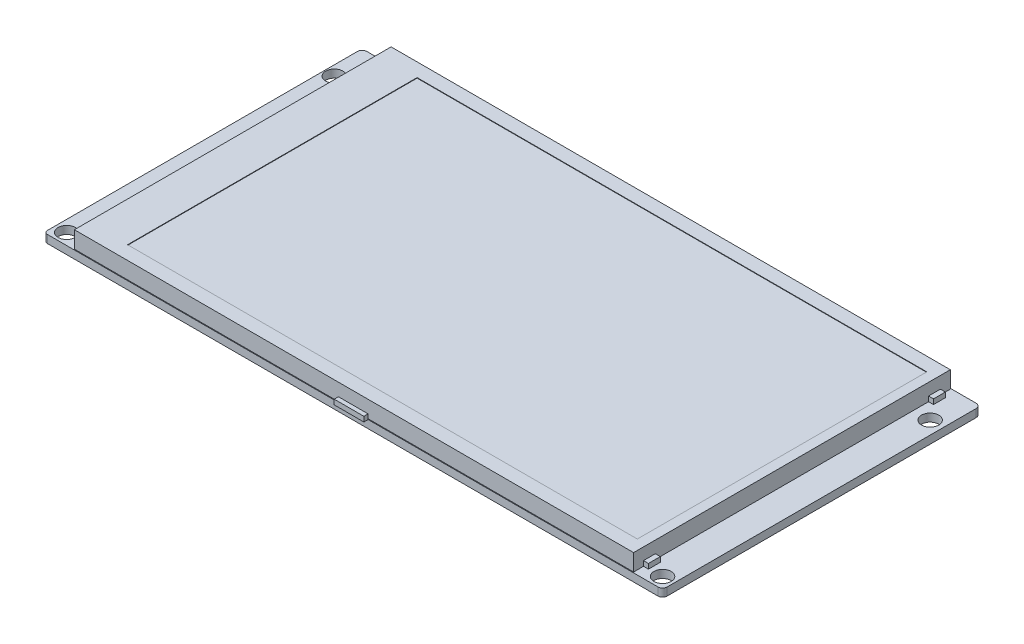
ISO-10303-21;
HEADER;
FILE_DESCRIPTION(('STEP AP214'),'2;1');
FILE_NAME('part.step','',(''),(''),'','','');
FILE_SCHEMA(('AUTOMOTIVE_DESIGN { 1 0 10303 214 1 1 1 1 }'));
ENDSEC;
DATA;
#1=APPLICATION_CONTEXT('core data for automotive mechanical design processes');
#2=APPLICATION_PROTOCOL_DEFINITION('international standard','automotive_design',2000,#1);
#3=PRODUCT_CONTEXT('',#1,'mechanical');
#4=PRODUCT('Part','Part','',(#3));
#5=PRODUCT_RELATED_PRODUCT_CATEGORY('part','',(#4));
#6=PRODUCT_DEFINITION_FORMATION('','',#4);
#7=PRODUCT_DEFINITION_CONTEXT('part definition',#1,'design');
#8=PRODUCT_DEFINITION('design','',#6,#7);
#9=PRODUCT_DEFINITION_SHAPE('','',#8);
#10=(LENGTH_UNIT() NAMED_UNIT(*) SI_UNIT(.MILLI.,.METRE.));
#11=(NAMED_UNIT(*) PLANE_ANGLE_UNIT() SI_UNIT($,.RADIAN.));
#12=(NAMED_UNIT(*) SI_UNIT($,.STERADIAN.) SOLID_ANGLE_UNIT());
#13=UNCERTAINTY_MEASURE_WITH_UNIT(LENGTH_MEASURE(1.E-05),#10,'distance_accuracy_value','');
#14=(GEOMETRIC_REPRESENTATION_CONTEXT(3) GLOBAL_UNCERTAINTY_ASSIGNED_CONTEXT((#13)) GLOBAL_UNIT_ASSIGNED_CONTEXT((#10,
#11,#12)) REPRESENTATION_CONTEXT('',''));
#15=CARTESIAN_POINT('',(0.,0.,0.));
#16=DIRECTION('',(0.,0.,1.));
#17=DIRECTION('',(1.,0.,0.));
#18=AXIS2_PLACEMENT_3D('',#15,#16,#17);
#19=CARTESIAN_POINT('',(-2.99999999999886,2.6,-1.04083408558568E-13));
#20=DIRECTION('',(1.,0.,0.));
#21=DIRECTION('',(0.,0.,-1.));
#22=AXIS2_PLACEMENT_3D('',#19,#20,#21);
#23=PLANE('',#22);
#24=DIRECTION('',(0.,0.,1.));
#25=VECTOR('',#24,1.);
#26=CARTESIAN_POINT('',(-2.99999999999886,1.6,-1.04083408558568E-13));
#27=LINE('',#26,#25);
#28=CARTESIAN_POINT('',(-2.99999999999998,1.6,32.15));
#29=VERTEX_POINT('',#28);
#30=CARTESIAN_POINT('',(-3.,1.6,33.));
#31=VERTEX_POINT('',#30);
#32=EDGE_CURVE('E108',#29,#31,#27,.T.);
#33=ORIENTED_EDGE('',*,*,#32,.T.);
#34=DIRECTION('',(0.,-1.,0.));
#35=VECTOR('',#34,1.);
#36=CARTESIAN_POINT('',(-3.,2.6,33.));
#37=LINE('',#36,#35);
#38=CARTESIAN_POINT('',(-3.,2.6,33.));
#39=VERTEX_POINT('',#38);
#40=EDGE_CURVE('E12',#39,#31,#37,.T.);
#41=ORIENTED_EDGE('',*,*,#40,.F.);
#42=DIRECTION('',(0.,0.,1.));
#43=VECTOR('',#42,1.);
#44=CARTESIAN_POINT('',(-2.99999999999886,2.6,-1.04083408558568E-13));
#45=LINE('',#44,#43);
#46=CARTESIAN_POINT('',(-2.99999999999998,2.6,32.15));
#47=VERTEX_POINT('',#46);
#48=EDGE_CURVE('E94',#47,#39,#45,.T.);
#49=ORIENTED_EDGE('',*,*,#48,.F.);
#50=DIRECTION('',(0.,-1.,0.));
#51=VECTOR('',#50,1.);
#52=CARTESIAN_POINT('',(-2.99999999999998,2.6,32.15));
#53=LINE('',#52,#51);
#54=EDGE_CURVE('E61',#47,#29,#53,.T.);
#55=ORIENTED_EDGE('',*,*,#54,.T.);
#56=EDGE_LOOP('',(#33,#41,#49,#55));
#57=FACE_BOUND('',#56,.T.);
#58=ADVANCED_FACE('F45',(#57),#23,.F.);
#59=CARTESIAN_POINT('',(0.,2.6,33.));
#60=DIRECTION('',(0.,0.,-1.));
#61=DIRECTION('',(-1.,0.,0.));
#62=AXIS2_PLACEMENT_3D('',#59,#60,#61);
#63=PLANE('',#62);
#64=DIRECTION('',(1.,0.,0.));
#65=VECTOR('',#64,1.);
#66=CARTESIAN_POINT('',(0.,1.6,33.));
#67=LINE('',#66,#65);
#68=CARTESIAN_POINT('',(3.00000000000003,1.6,33.));
#69=VERTEX_POINT('',#68);
#70=EDGE_CURVE('E99',#31,#69,#67,.T.);
#71=ORIENTED_EDGE('',*,*,#70,.T.);
#72=DIRECTION('',(0.,-1.,0.));
#73=VECTOR('',#72,1.);
#74=CARTESIAN_POINT('',(3.00000000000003,2.6,33.));
#75=LINE('',#74,#73);
#76=CARTESIAN_POINT('',(3.00000000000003,2.6,33.));
#77=VERTEX_POINT('',#76);
#78=EDGE_CURVE('E53',#77,#69,#75,.T.);
#79=ORIENTED_EDGE('',*,*,#78,.F.);
#80=DIRECTION('',(1.,0.,0.));
#81=VECTOR('',#80,1.);
#82=CARTESIAN_POINT('',(0.,2.6,33.));
#83=LINE('',#82,#81);
#84=EDGE_CURVE('E86',#39,#77,#83,.T.);
#85=ORIENTED_EDGE('',*,*,#84,.F.);
#86=ORIENTED_EDGE('',*,*,#40,.T.);
#87=EDGE_LOOP('',(#71,#79,#85,#86));
#88=FACE_BOUND('',#87,.T.);
#89=ADVANCED_FACE('F98',(#88),#63,.F.);
#90=CARTESIAN_POINT('',(2.99999999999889,2.6,-1.04083408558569E-13));
#91=DIRECTION('',(1.,0.,0.));
#92=DIRECTION('',(0.,0.,-1.));
#93=AXIS2_PLACEMENT_3D('',#90,#91,#92);
#94=PLANE('',#93);
#95=DIRECTION('',(0.,0.,1.));
#96=VECTOR('',#95,1.);
#97=CARTESIAN_POINT('',(2.99999999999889,1.6,-1.04083408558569E-13));
#98=LINE('',#97,#96);
#99=CARTESIAN_POINT('',(3.00000000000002,1.6,32.15));
#100=VERTEX_POINT('',#99);
#101=EDGE_CURVE('E111',#100,#69,#98,.T.);
#102=ORIENTED_EDGE('',*,*,#101,.F.);
#103=DIRECTION('',(0.,-1.,0.));
#104=VECTOR('',#103,1.);
#105=CARTESIAN_POINT('',(3.00000000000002,2.6,32.15));
#106=LINE('',#105,#104);
#107=CARTESIAN_POINT('',(3.00000000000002,2.6,32.15));
#108=VERTEX_POINT('',#107);
#109=EDGE_CURVE('E75',#108,#100,#106,.T.);
#110=ORIENTED_EDGE('',*,*,#109,.F.);
#111=DIRECTION('',(0.,0.,1.));
#112=VECTOR('',#111,1.);
#113=CARTESIAN_POINT('',(2.99999999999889,2.6,-1.04083408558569E-13));
#114=LINE('',#113,#112);
#115=EDGE_CURVE('E93',#108,#77,#114,.T.);
#116=ORIENTED_EDGE('',*,*,#115,.T.);
#117=ORIENTED_EDGE('',*,*,#78,.T.);
#118=EDGE_LOOP('',(#102,#110,#116,#117));
#119=FACE_BOUND('',#118,.T.);
#120=ADVANCED_FACE('F102',(#119),#94,.T.);
#121=CARTESIAN_POINT('',(0.,2.6,32.15));
#122=DIRECTION('',(0.,0.,-1.));
#123=DIRECTION('',(-1.,0.,0.));
#124=AXIS2_PLACEMENT_3D('',#121,#122,#123);
#125=PLANE('',#124);
#126=DIRECTION('',(1.,0.,0.));
#127=VECTOR('',#126,1.);
#128=CARTESIAN_POINT('',(0.,1.6,32.15));
#129=LINE('',#128,#127);
#130=EDGE_CURVE('E113',#29,#100,#129,.T.);
#131=ORIENTED_EDGE('',*,*,#130,.F.);
#132=ORIENTED_EDGE('',*,*,#54,.F.);
#133=DIRECTION('',(1.,0.,0.));
#134=VECTOR('',#133,1.);
#135=CARTESIAN_POINT('',(0.,2.6,32.15));
#136=LINE('',#135,#134);
#137=EDGE_CURVE('E103',#47,#108,#136,.T.);
#138=ORIENTED_EDGE('',*,*,#137,.T.);
#139=ORIENTED_EDGE('',*,*,#109,.T.);
#140=EDGE_LOOP('',(#131,#132,#138,#139));
#141=FACE_BOUND('',#140,.T.);
#142=ADVANCED_FACE('F119',(#141),#125,.T.);
#143=CARTESIAN_POINT('',(0.,2.6,0.));
#144=DIRECTION('',(0.,1.,0.));
#145=DIRECTION('',(0.,0.,1.));
#146=AXIS2_PLACEMENT_3D('',#143,#144,#145);
#147=PLANE('',#146);
#148=ORIENTED_EDGE('',*,*,#48,.T.);
#149=ORIENTED_EDGE('',*,*,#84,.T.);
#150=ORIENTED_EDGE('',*,*,#115,.F.);
#151=ORIENTED_EDGE('',*,*,#137,.F.);
#152=EDGE_LOOP('',(#148,#149,#150,#151));
#153=FACE_BOUND('',#152,.T.);
#154=ADVANCED_FACE('F90',(#153),#147,.T.);
#155=CARTESIAN_POINT('',(0.,1.6,0.));
#156=DIRECTION('',(0.,1.,0.));
#157=DIRECTION('',(0.,0.,1.));
#158=AXIS2_PLACEMENT_3D('',#155,#156,#157);
#159=PLANE('',#158);
#160=ORIENTED_EDGE('',*,*,#32,.F.);
#161=ORIENTED_EDGE('',*,*,#130,.T.);
#162=ORIENTED_EDGE('',*,*,#101,.T.);
#163=ORIENTED_EDGE('',*,*,#70,.F.);
#164=EDGE_LOOP('',(#160,#161,#162,#163));
#165=FACE_BOUND('',#164,.T.);
#166=ADVANCED_FACE('F118',(#165),#159,.F.);
#167=CLOSED_SHELL('',(#58,#89,#120,#142,#154,#166));
#168=MANIFOLD_SOLID_BREP('B2',#167);
#169=CARTESIAN_POINT('',(0.,2.6,-32.15));
#170=DIRECTION('',(0.,0.,-1.));
#171=DIRECTION('',(-1.,0.,0.));
#172=AXIS2_PLACEMENT_3D('',#169,#170,#171);
#173=PLANE('',#172);
#174=DIRECTION('',(1.,0.,0.));
#175=VECTOR('',#174,1.);
#176=CARTESIAN_POINT('',(0.,1.6,-32.15));
#177=LINE('',#176,#175);
#178=CARTESIAN_POINT('',(-3.,1.6,-32.15));
#179=VERTEX_POINT('',#178);
#180=CARTESIAN_POINT('',(3.,1.6,-32.15));
#181=VERTEX_POINT('',#180);
#182=EDGE_CURVE('E241',#179,#181,#177,.T.);
#183=ORIENTED_EDGE('',*,*,#182,.T.);
#184=DIRECTION('',(0.,-1.,0.));
#185=VECTOR('',#184,1.);
#186=CARTESIAN_POINT('',(3.,2.6,-32.15));
#187=LINE('',#186,#185);
#188=CARTESIAN_POINT('',(3.,2.6,-32.15));
#189=VERTEX_POINT('',#188);
#190=EDGE_CURVE('E43',#189,#181,#187,.T.);
#191=ORIENTED_EDGE('',*,*,#190,.F.);
#192=DIRECTION('',(1.,0.,0.));
#193=VECTOR('',#192,1.);
#194=CARTESIAN_POINT('',(0.,2.6,-32.15));
#195=LINE('',#194,#193);
#196=CARTESIAN_POINT('',(-3.,2.6,-32.15));
#197=VERTEX_POINT('',#196);
#198=EDGE_CURVE('E227',#197,#189,#195,.T.);
#199=ORIENTED_EDGE('',*,*,#198,.F.);
#200=DIRECTION('',(0.,-1.,0.));
#201=VECTOR('',#200,1.);
#202=CARTESIAN_POINT('',(-3.,2.6,-32.15));
#203=LINE('',#202,#201);
#204=EDGE_CURVE('E194',#197,#179,#203,.T.);
#205=ORIENTED_EDGE('',*,*,#204,.T.);
#206=EDGE_LOOP('',(#183,#191,#199,#205));
#207=FACE_BOUND('',#206,.T.);
#208=ADVANCED_FACE('F178',(#207),#173,.F.);
#209=CARTESIAN_POINT('',(3.,2.6,0.));
#210=DIRECTION('',(-1.,0.,0.));
#211=DIRECTION('',(0.,0.,1.));
#212=AXIS2_PLACEMENT_3D('',#209,#210,#211);
#213=PLANE('',#212);
#214=DIRECTION('',(0.,0.,-1.));
#215=VECTOR('',#214,1.);
#216=CARTESIAN_POINT('',(3.,1.6,0.));
#217=LINE('',#216,#215);
#218=CARTESIAN_POINT('',(3.,1.6,-33.));
#219=VERTEX_POINT('',#218);
#220=EDGE_CURVE('E232',#181,#219,#217,.T.);
#221=ORIENTED_EDGE('',*,*,#220,.T.);
#222=DIRECTION('',(0.,-1.,0.));
#223=VECTOR('',#222,1.);
#224=CARTESIAN_POINT('',(3.,2.6,-33.));
#225=LINE('',#224,#223);
#226=CARTESIAN_POINT('',(3.,2.6,-33.));
#227=VERTEX_POINT('',#226);
#228=EDGE_CURVE('E186',#227,#219,#225,.T.);
#229=ORIENTED_EDGE('',*,*,#228,.F.);
#230=DIRECTION('',(0.,0.,-1.));
#231=VECTOR('',#230,1.);
#232=CARTESIAN_POINT('',(3.,2.6,0.));
#233=LINE('',#232,#231);
#234=EDGE_CURVE('E219',#189,#227,#233,.T.);
#235=ORIENTED_EDGE('',*,*,#234,.F.);
#236=ORIENTED_EDGE('',*,*,#190,.T.);
#237=EDGE_LOOP('',(#221,#229,#235,#236));
#238=FACE_BOUND('',#237,.T.);
#239=ADVANCED_FACE('F231',(#238),#213,.F.);
#240=CARTESIAN_POINT('',(0.,2.6,-33.));
#241=DIRECTION('',(0.,0.,-1.));
#242=DIRECTION('',(-1.,0.,0.));
#243=AXIS2_PLACEMENT_3D('',#240,#241,#242);
#244=PLANE('',#243);
#245=DIRECTION('',(1.,0.,0.));
#246=VECTOR('',#245,1.);
#247=CARTESIAN_POINT('',(0.,1.6,-33.));
#248=LINE('',#247,#246);
#249=CARTESIAN_POINT('',(-3.,1.6,-33.));
#250=VERTEX_POINT('',#249);
#251=EDGE_CURVE('E244',#250,#219,#248,.T.);
#252=ORIENTED_EDGE('',*,*,#251,.F.);
#253=DIRECTION('',(0.,-1.,0.));
#254=VECTOR('',#253,1.);
#255=CARTESIAN_POINT('',(-3.,2.6,-33.));
#256=LINE('',#255,#254);
#257=CARTESIAN_POINT('',(-3.,2.6,-33.));
#258=VERTEX_POINT('',#257);
#259=EDGE_CURVE('E208',#258,#250,#256,.T.);
#260=ORIENTED_EDGE('',*,*,#259,.F.);
#261=DIRECTION('',(1.,0.,0.));
#262=VECTOR('',#261,1.);
#263=CARTESIAN_POINT('',(0.,2.6,-33.));
#264=LINE('',#263,#262);
#265=EDGE_CURVE('E226',#258,#227,#264,.T.);
#266=ORIENTED_EDGE('',*,*,#265,.T.);
#267=ORIENTED_EDGE('',*,*,#228,.T.);
#268=EDGE_LOOP('',(#252,#260,#266,#267));
#269=FACE_BOUND('',#268,.T.);
#270=ADVANCED_FACE('F235',(#269),#244,.T.);
#271=CARTESIAN_POINT('',(-3.,2.6,0.));
#272=DIRECTION('',(-1.,0.,0.));
#273=DIRECTION('',(0.,0.,1.));
#274=AXIS2_PLACEMENT_3D('',#271,#272,#273);
#275=PLANE('',#274);
#276=DIRECTION('',(0.,0.,-1.));
#277=VECTOR('',#276,1.);
#278=CARTESIAN_POINT('',(-3.,1.6,0.));
#279=LINE('',#278,#277);
#280=EDGE_CURVE('E246',#179,#250,#279,.T.);
#281=ORIENTED_EDGE('',*,*,#280,.F.);
#282=ORIENTED_EDGE('',*,*,#204,.F.);
#283=DIRECTION('',(0.,0.,-1.));
#284=VECTOR('',#283,1.);
#285=CARTESIAN_POINT('',(-3.,2.6,0.));
#286=LINE('',#285,#284);
#287=EDGE_CURVE('E236',#197,#258,#286,.T.);
#288=ORIENTED_EDGE('',*,*,#287,.T.);
#289=ORIENTED_EDGE('',*,*,#259,.T.);
#290=EDGE_LOOP('',(#281,#282,#288,#289));
#291=FACE_BOUND('',#290,.T.);
#292=ADVANCED_FACE('F252',(#291),#275,.T.);
#293=CARTESIAN_POINT('',(0.,2.6,0.));
#294=DIRECTION('',(0.,1.,0.));
#295=DIRECTION('',(0.,0.,1.));
#296=AXIS2_PLACEMENT_3D('',#293,#294,#295);
#297=PLANE('',#296);
#298=ORIENTED_EDGE('',*,*,#198,.T.);
#299=ORIENTED_EDGE('',*,*,#234,.T.);
#300=ORIENTED_EDGE('',*,*,#265,.F.);
#301=ORIENTED_EDGE('',*,*,#287,.F.);
#302=EDGE_LOOP('',(#298,#299,#300,#301));
#303=FACE_BOUND('',#302,.T.);
#304=ADVANCED_FACE('F223',(#303),#297,.T.);
#305=CARTESIAN_POINT('',(0.,1.6,0.));
#306=DIRECTION('',(0.,1.,0.));
#307=DIRECTION('',(0.,0.,1.));
#308=AXIS2_PLACEMENT_3D('',#305,#306,#307);
#309=PLANE('',#308);
#310=ORIENTED_EDGE('',*,*,#182,.F.);
#311=ORIENTED_EDGE('',*,*,#280,.T.);
#312=ORIENTED_EDGE('',*,*,#251,.T.);
#313=ORIENTED_EDGE('',*,*,#220,.F.);
#314=EDGE_LOOP('',(#310,#311,#312,#313));
#315=FACE_BOUND('',#314,.T.);
#316=ADVANCED_FACE('F251',(#315),#309,.F.);
#317=CLOSED_SHELL('',(#208,#239,#270,#292,#304,#316));
#318=MANIFOLD_SOLID_BREP('B6',#317);
#319=CARTESIAN_POINT('',(-2.99999999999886,2.6,-1.04083408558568E-13));
#320=DIRECTION('',(1.,0.,0.));
#321=DIRECTION('',(0.,0.,-1.));
#322=AXIS2_PLACEMENT_3D('',#319,#320,#321);
#323=PLANE('',#322);
#324=DIRECTION('',(0.,0.,1.));
#325=VECTOR('',#324,1.);
#326=CARTESIAN_POINT('',(-2.99999999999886,1.6,-1.04083408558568E-13));
#327=LINE('',#326,#325);
#328=CARTESIAN_POINT('',(-2.99999999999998,1.6,32.15));
#329=VERTEX_POINT('',#328);
#330=CARTESIAN_POINT('',(-3.,1.6,33.));
#331=VERTEX_POINT('',#330);
#332=EDGE_CURVE('E374',#329,#331,#327,.T.);
#333=ORIENTED_EDGE('',*,*,#332,.T.);
#334=DIRECTION('',(0.,-1.,0.));
#335=VECTOR('',#334,1.);
#336=CARTESIAN_POINT('',(-3.,2.6,33.));
#337=LINE('',#336,#335);
#338=CARTESIAN_POINT('',(-3.,2.6,33.));
#339=VERTEX_POINT('',#338);
#340=EDGE_CURVE('E176',#339,#331,#337,.T.);
#341=ORIENTED_EDGE('',*,*,#340,.F.);
#342=DIRECTION('',(0.,0.,1.));
#343=VECTOR('',#342,1.);
#344=CARTESIAN_POINT('',(-2.99999999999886,2.6,-1.04083408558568E-13));
#345=LINE('',#344,#343);
#346=CARTESIAN_POINT('',(-2.99999999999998,2.6,32.15));
#347=VERTEX_POINT('',#346);
#348=EDGE_CURVE('E360',#347,#339,#345,.T.);
#349=ORIENTED_EDGE('',*,*,#348,.F.);
#350=DIRECTION('',(0.,-1.,0.));
#351=VECTOR('',#350,1.);
#352=CARTESIAN_POINT('',(-2.99999999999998,2.6,32.15));
#353=LINE('',#352,#351);
#354=EDGE_CURVE('E327',#347,#329,#353,.T.);
#355=ORIENTED_EDGE('',*,*,#354,.T.);
#356=EDGE_LOOP('',(#333,#341,#349,#355));
#357=FACE_BOUND('',#356,.T.);
#358=ADVANCED_FACE('F311',(#357),#323,.F.);
#359=CARTESIAN_POINT('',(0.,2.6,33.));
#360=DIRECTION('',(0.,0.,-1.));
#361=DIRECTION('',(-1.,0.,0.));
#362=AXIS2_PLACEMENT_3D('',#359,#360,#361);
#363=PLANE('',#362);
#364=DIRECTION('',(1.,0.,0.));
#365=VECTOR('',#364,1.);
#366=CARTESIAN_POINT('',(0.,1.6,33.));
#367=LINE('',#366,#365);
#368=CARTESIAN_POINT('',(3.00000000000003,1.6,33.));
#369=VERTEX_POINT('',#368);
#370=EDGE_CURVE('E365',#331,#369,#367,.T.);
#371=ORIENTED_EDGE('',*,*,#370,.T.);
#372=DIRECTION('',(0.,-1.,0.));
#373=VECTOR('',#372,1.);
#374=CARTESIAN_POINT('',(3.00000000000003,2.6,33.));
#375=LINE('',#374,#373);
#376=CARTESIAN_POINT('',(3.00000000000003,2.6,33.));
#377=VERTEX_POINT('',#376);
#378=EDGE_CURVE('E319',#377,#369,#375,.T.);
#379=ORIENTED_EDGE('',*,*,#378,.F.);
#380=DIRECTION('',(1.,0.,0.));
#381=VECTOR('',#380,1.);
#382=CARTESIAN_POINT('',(0.,2.6,33.));
#383=LINE('',#382,#381);
#384=EDGE_CURVE('E352',#339,#377,#383,.T.);
#385=ORIENTED_EDGE('',*,*,#384,.F.);
#386=ORIENTED_EDGE('',*,*,#340,.T.);
#387=EDGE_LOOP('',(#371,#379,#385,#386));
#388=FACE_BOUND('',#387,.T.);
#389=ADVANCED_FACE('F364',(#388),#363,.F.);
#390=CARTESIAN_POINT('',(2.99999999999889,2.6,-1.04083408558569E-13));
#391=DIRECTION('',(1.,0.,0.));
#392=DIRECTION('',(0.,0.,-1.));
#393=AXIS2_PLACEMENT_3D('',#390,#391,#392);
#394=PLANE('',#393);
#395=DIRECTION('',(0.,0.,1.));
#396=VECTOR('',#395,1.);
#397=CARTESIAN_POINT('',(2.99999999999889,1.6,-1.04083408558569E-13));
#398=LINE('',#397,#396);
#399=CARTESIAN_POINT('',(3.00000000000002,1.6,32.15));
#400=VERTEX_POINT('',#399);
#401=EDGE_CURVE('E377',#400,#369,#398,.T.);
#402=ORIENTED_EDGE('',*,*,#401,.F.);
#403=DIRECTION('',(0.,-1.,0.));
#404=VECTOR('',#403,1.);
#405=CARTESIAN_POINT('',(3.00000000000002,2.6,32.15));
#406=LINE('',#405,#404);
#407=CARTESIAN_POINT('',(3.00000000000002,2.6,32.15));
#408=VERTEX_POINT('',#407);
#409=EDGE_CURVE('E341',#408,#400,#406,.T.);
#410=ORIENTED_EDGE('',*,*,#409,.F.);
#411=DIRECTION('',(0.,0.,1.));
#412=VECTOR('',#411,1.);
#413=CARTESIAN_POINT('',(2.99999999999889,2.6,-1.04083408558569E-13));
#414=LINE('',#413,#412);
#415=EDGE_CURVE('E359',#408,#377,#414,.T.);
#416=ORIENTED_EDGE('',*,*,#415,.T.);
#417=ORIENTED_EDGE('',*,*,#378,.T.);
#418=EDGE_LOOP('',(#402,#410,#416,#417));
#419=FACE_BOUND('',#418,.T.);
#420=ADVANCED_FACE('F368',(#419),#394,.T.);
#421=CARTESIAN_POINT('',(0.,2.6,32.15));
#422=DIRECTION('',(0.,0.,-1.));
#423=DIRECTION('',(-1.,0.,0.));
#424=AXIS2_PLACEMENT_3D('',#421,#422,#423);
#425=PLANE('',#424);
#426=DIRECTION('',(1.,0.,0.));
#427=VECTOR('',#426,1.);
#428=CARTESIAN_POINT('',(0.,1.6,32.15));
#429=LINE('',#428,#427);
#430=EDGE_CURVE('E379',#329,#400,#429,.T.);
#431=ORIENTED_EDGE('',*,*,#430,.F.);
#432=ORIENTED_EDGE('',*,*,#354,.F.);
#433=DIRECTION('',(1.,0.,0.));
#434=VECTOR('',#433,1.);
#435=CARTESIAN_POINT('',(0.,2.6,32.15));
#436=LINE('',#435,#434);
#437=EDGE_CURVE('E369',#347,#408,#436,.T.);
#438=ORIENTED_EDGE('',*,*,#437,.T.);
#439=ORIENTED_EDGE('',*,*,#409,.T.);
#440=EDGE_LOOP('',(#431,#432,#438,#439));
#441=FACE_BOUND('',#440,.T.);
#442=ADVANCED_FACE('F385',(#441),#425,.T.);
#443=CARTESIAN_POINT('',(0.,2.6,0.));
#444=DIRECTION('',(0.,1.,0.));
#445=DIRECTION('',(0.,0.,1.));
#446=AXIS2_PLACEMENT_3D('',#443,#444,#445);
#447=PLANE('',#446);
#448=ORIENTED_EDGE('',*,*,#348,.T.);
#449=ORIENTED_EDGE('',*,*,#384,.T.);
#450=ORIENTED_EDGE('',*,*,#415,.F.);
#451=ORIENTED_EDGE('',*,*,#437,.F.);
#452=EDGE_LOOP('',(#448,#449,#450,#451));
#453=FACE_BOUND('',#452,.T.);
#454=ADVANCED_FACE('F356',(#453),#447,.T.);
#455=CARTESIAN_POINT('',(0.,1.6,0.));
#456=DIRECTION('',(0.,1.,0.));
#457=DIRECTION('',(0.,0.,1.));
#458=AXIS2_PLACEMENT_3D('',#455,#456,#457);
#459=PLANE('',#458);
#460=ORIENTED_EDGE('',*,*,#332,.F.);
#461=ORIENTED_EDGE('',*,*,#430,.T.);
#462=ORIENTED_EDGE('',*,*,#401,.T.);
#463=ORIENTED_EDGE('',*,*,#370,.F.);
#464=EDGE_LOOP('',(#460,#461,#462,#463));
#465=FACE_BOUND('',#464,.T.);
#466=ADVANCED_FACE('F384',(#465),#459,.F.);
#467=CLOSED_SHELL('',(#358,#389,#420,#442,#454,#466));
#468=MANIFOLD_SOLID_BREP('B37',#467);
#469=CARTESIAN_POINT('',(0.,2.6,-32.15));
#470=DIRECTION('',(0.,0.,-1.));
#471=DIRECTION('',(-1.,0.,0.));
#472=AXIS2_PLACEMENT_3D('',#469,#470,#471);
#473=PLANE('',#472);
#474=DIRECTION('',(1.,0.,0.));
#475=VECTOR('',#474,1.);
#476=CARTESIAN_POINT('',(0.,1.6,-32.15));
#477=LINE('',#476,#475);
#478=CARTESIAN_POINT('',(-3.,1.6,-32.15));
#479=VERTEX_POINT('',#478);
#480=CARTESIAN_POINT('',(3.,1.6,-32.15));
#481=VERTEX_POINT('',#480);
#482=EDGE_CURVE('E506',#479,#481,#477,.T.);
#483=ORIENTED_EDGE('',*,*,#482,.T.);
#484=DIRECTION('',(0.,-1.,0.));
#485=VECTOR('',#484,1.);
#486=CARTESIAN_POINT('',(3.,2.6,-32.15));
#487=LINE('',#486,#485);
#488=CARTESIAN_POINT('',(3.,2.6,-32.15));
#489=VERTEX_POINT('',#488);
#490=EDGE_CURVE('E309',#489,#481,#487,.T.);
#491=ORIENTED_EDGE('',*,*,#490,.F.);
#492=DIRECTION('',(1.,0.,0.));
#493=VECTOR('',#492,1.);
#494=CARTESIAN_POINT('',(0.,2.6,-32.15));
#495=LINE('',#494,#493);
#496=CARTESIAN_POINT('',(-3.,2.6,-32.15));
#497=VERTEX_POINT('',#496);
#498=EDGE_CURVE('E492',#497,#489,#495,.T.);
#499=ORIENTED_EDGE('',*,*,#498,.F.);
#500=DIRECTION('',(0.,-1.,0.));
#501=VECTOR('',#500,1.);
#502=CARTESIAN_POINT('',(-3.,2.6,-32.15));
#503=LINE('',#502,#501);
#504=EDGE_CURVE('E459',#497,#479,#503,.T.);
#505=ORIENTED_EDGE('',*,*,#504,.T.);
#506=EDGE_LOOP('',(#483,#491,#499,#505));
#507=FACE_BOUND('',#506,.T.);
#508=ADVANCED_FACE('F443',(#507),#473,.F.);
#509=CARTESIAN_POINT('',(3.,2.6,0.));
#510=DIRECTION('',(-1.,0.,0.));
#511=DIRECTION('',(0.,0.,1.));
#512=AXIS2_PLACEMENT_3D('',#509,#510,#511);
#513=PLANE('',#512);
#514=DIRECTION('',(0.,0.,-1.));
#515=VECTOR('',#514,1.);
#516=CARTESIAN_POINT('',(3.,1.6,0.));
#517=LINE('',#516,#515);
#518=CARTESIAN_POINT('',(3.,1.6,-33.));
#519=VERTEX_POINT('',#518);
#520=EDGE_CURVE('E497',#481,#519,#517,.T.);
#521=ORIENTED_EDGE('',*,*,#520,.T.);
#522=DIRECTION('',(0.,-1.,0.));
#523=VECTOR('',#522,1.);
#524=CARTESIAN_POINT('',(3.,2.6,-33.));
#525=LINE('',#524,#523);
#526=CARTESIAN_POINT('',(3.,2.6,-33.));
#527=VERTEX_POINT('',#526);
#528=EDGE_CURVE('E451',#527,#519,#525,.T.);
#529=ORIENTED_EDGE('',*,*,#528,.F.);
#530=DIRECTION('',(0.,0.,-1.));
#531=VECTOR('',#530,1.);
#532=CARTESIAN_POINT('',(3.,2.6,0.));
#533=LINE('',#532,#531);
#534=EDGE_CURVE('E484',#489,#527,#533,.T.);
#535=ORIENTED_EDGE('',*,*,#534,.F.);
#536=ORIENTED_EDGE('',*,*,#490,.T.);
#537=EDGE_LOOP('',(#521,#529,#535,#536));
#538=FACE_BOUND('',#537,.T.);
#539=ADVANCED_FACE('F496',(#538),#513,.F.);
#540=CARTESIAN_POINT('',(0.,2.6,-33.));
#541=DIRECTION('',(0.,0.,-1.));
#542=DIRECTION('',(-1.,0.,0.));
#543=AXIS2_PLACEMENT_3D('',#540,#541,#542);
#544=PLANE('',#543);
#545=DIRECTION('',(1.,0.,0.));
#546=VECTOR('',#545,1.);
#547=CARTESIAN_POINT('',(0.,1.6,-33.));
#548=LINE('',#547,#546);
#549=CARTESIAN_POINT('',(-3.,1.6,-33.));
#550=VERTEX_POINT('',#549);
#551=EDGE_CURVE('E509',#550,#519,#548,.T.);
#552=ORIENTED_EDGE('',*,*,#551,.F.);
#553=DIRECTION('',(0.,-1.,0.));
#554=VECTOR('',#553,1.);
#555=CARTESIAN_POINT('',(-3.,2.6,-33.));
#556=LINE('',#555,#554);
#557=CARTESIAN_POINT('',(-3.,2.6,-33.));
#558=VERTEX_POINT('',#557);
#559=EDGE_CURVE('E473',#558,#550,#556,.T.);
#560=ORIENTED_EDGE('',*,*,#559,.F.);
#561=DIRECTION('',(1.,0.,0.));
#562=VECTOR('',#561,1.);
#563=CARTESIAN_POINT('',(0.,2.6,-33.));
#564=LINE('',#563,#562);
#565=EDGE_CURVE('E491',#558,#527,#564,.T.);
#566=ORIENTED_EDGE('',*,*,#565,.T.);
#567=ORIENTED_EDGE('',*,*,#528,.T.);
#568=EDGE_LOOP('',(#552,#560,#566,#567));
#569=FACE_BOUND('',#568,.T.);
#570=ADVANCED_FACE('F500',(#569),#544,.T.);
#571=CARTESIAN_POINT('',(-3.,2.6,0.));
#572=DIRECTION('',(-1.,0.,0.));
#573=DIRECTION('',(0.,0.,1.));
#574=AXIS2_PLACEMENT_3D('',#571,#572,#573);
#575=PLANE('',#574);
#576=DIRECTION('',(0.,0.,-1.));
#577=VECTOR('',#576,1.);
#578=CARTESIAN_POINT('',(-3.,1.6,0.));
#579=LINE('',#578,#577);
#580=EDGE_CURVE('E511',#479,#550,#579,.T.);
#581=ORIENTED_EDGE('',*,*,#580,.F.);
#582=ORIENTED_EDGE('',*,*,#504,.F.);
#583=DIRECTION('',(0.,0.,-1.));
#584=VECTOR('',#583,1.);
#585=CARTESIAN_POINT('',(-3.,2.6,0.));
#586=LINE('',#585,#584);
#587=EDGE_CURVE('E501',#497,#558,#586,.T.);
#588=ORIENTED_EDGE('',*,*,#587,.T.);
#589=ORIENTED_EDGE('',*,*,#559,.T.);
#590=EDGE_LOOP('',(#581,#582,#588,#589));
#591=FACE_BOUND('',#590,.T.);
#592=ADVANCED_FACE('F517',(#591),#575,.T.);
#593=CARTESIAN_POINT('',(0.,2.6,0.));
#594=DIRECTION('',(0.,1.,0.));
#595=DIRECTION('',(0.,0.,1.));
#596=AXIS2_PLACEMENT_3D('',#593,#594,#595);
#597=PLANE('',#596);
#598=ORIENTED_EDGE('',*,*,#498,.T.);
#599=ORIENTED_EDGE('',*,*,#534,.T.);
#600=ORIENTED_EDGE('',*,*,#565,.F.);
#601=ORIENTED_EDGE('',*,*,#587,.F.);
#602=EDGE_LOOP('',(#598,#599,#600,#601));
#603=FACE_BOUND('',#602,.T.);
#604=ADVANCED_FACE('F488',(#603),#597,.T.);
#605=CARTESIAN_POINT('',(0.,1.6,0.));
#606=DIRECTION('',(0.,1.,0.));
#607=DIRECTION('',(0.,0.,1.));
#608=AXIS2_PLACEMENT_3D('',#605,#606,#607);
#609=PLANE('',#608);
#610=ORIENTED_EDGE('',*,*,#482,.F.);
#611=ORIENTED_EDGE('',*,*,#580,.T.);
#612=ORIENTED_EDGE('',*,*,#551,.T.);
#613=ORIENTED_EDGE('',*,*,#520,.F.);
#614=EDGE_LOOP('',(#610,#611,#612,#613));
#615=FACE_BOUND('',#614,.T.);
#616=ADVANCED_FACE('F516',(#615),#609,.F.);
#617=CLOSED_SHELL('',(#508,#539,#570,#592,#604,#616));
#618=MANIFOLD_SOLID_BREP('B170',#617);
#619=CARTESIAN_POINT('',(0.,1.6,0.));
#620=DIRECTION('',(0.,1.,0.));
#621=DIRECTION('',(0.,0.,1.));
#622=AXIS2_PLACEMENT_3D('',#619,#620,#621);
#623=PLANE('',#622);
#624=DIRECTION('',(1.,0.,0.));
#625=VECTOR('',#624,1.);
#626=CARTESIAN_POINT('',(0.,1.6,-30.));
#627=LINE('',#626,#625);
#628=CARTESIAN_POINT('',(56.5,1.6,-30.));
#629=VERTEX_POINT('',#628);
#630=CARTESIAN_POINT('',(57.5,1.6,-30.));
#631=VERTEX_POINT('',#630);
#632=EDGE_CURVE('E589',#629,#631,#627,.T.);
#633=ORIENTED_EDGE('',*,*,#632,.T.);
#634=DIRECTION('',(0.,0.,1.));
#635=VECTOR('',#634,1.);
#636=CARTESIAN_POINT('',(57.4999999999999,1.6,3.32488666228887E-13));
#637=LINE('',#636,#635);
#638=CARTESIAN_POINT('',(57.5,1.6,-27.6));
#639=VERTEX_POINT('',#638);
#640=EDGE_CURVE('E817',#631,#639,#637,.T.);
#641=ORIENTED_EDGE('',*,*,#640,.T.);
#642=DIRECTION('',(1.,0.,0.));
#643=VECTOR('',#642,1.);
#644=CARTESIAN_POINT('',(0.,1.6,-27.6));
#645=LINE('',#644,#643);
#646=CARTESIAN_POINT('',(56.5,1.6,-27.6));
#647=VERTEX_POINT('',#646);
#648=EDGE_CURVE('E827',#647,#639,#645,.T.);
#649=ORIENTED_EDGE('',*,*,#648,.F.);
#650=DIRECTION('',(0.,0.,-1.));
#651=VECTOR('',#650,1.);
#652=CARTESIAN_POINT('',(56.5,1.6,0.));
#653=LINE('',#652,#651);
#654=CARTESIAN_POINT('',(56.5,1.6,27.6));
#655=VERTEX_POINT('',#654);
#656=EDGE_CURVE('E964',#655,#647,#653,.T.);
#657=ORIENTED_EDGE('',*,*,#656,.F.);
#658=DIRECTION('',(1.,0.,0.));
#659=VECTOR('',#658,1.);
#660=CARTESIAN_POINT('',(0.,1.6,27.6));
#661=LINE('',#660,#659);
#662=CARTESIAN_POINT('',(57.5,1.6,27.6));
#663=VERTEX_POINT('',#662);
#664=EDGE_CURVE('E845',#655,#663,#661,.T.);
#665=ORIENTED_EDGE('',*,*,#664,.T.);
#666=DIRECTION('',(0.,0.,-1.));
#667=VECTOR('',#666,1.);
#668=CARTESIAN_POINT('',(57.4999999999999,1.6,-3.32488666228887E-13));
#669=LINE('',#668,#667);
#670=CARTESIAN_POINT('',(57.5,1.6,30.));
#671=VERTEX_POINT('',#670);
#672=EDGE_CURVE('E855',#671,#663,#669,.T.);
#673=ORIENTED_EDGE('',*,*,#672,.F.);
#674=DIRECTION('',(1.,0.,0.));
#675=VECTOR('',#674,1.);
#676=CARTESIAN_POINT('',(0.,1.6,30.));
#677=LINE('',#676,#675);
#678=CARTESIAN_POINT('',(56.5,1.6,30.));
#679=VERTEX_POINT('',#678);
#680=EDGE_CURVE('E840',#679,#671,#677,.T.);
#681=ORIENTED_EDGE('',*,*,#680,.F.);
#682=CARTESIAN_POINT('',(56.5,1.6,32.));
#683=VERTEX_POINT('',#682);
#684=EDGE_CURVE('E960',#683,#679,#653,.T.);
#685=ORIENTED_EDGE('',*,*,#684,.F.);
#686=DIRECTION('',(-1.,0.,0.));
#687=VECTOR('',#686,1.);
#688=CARTESIAN_POINT('',(0.,1.6,32.));
#689=LINE('',#688,#687);
#690=CARTESIAN_POINT('',(-56.5,1.6,32.));
#691=VERTEX_POINT('',#690);
#692=EDGE_CURVE('E948',#683,#691,#689,.T.);
#693=ORIENTED_EDGE('',*,*,#692,.T.);
#694=DIRECTION('',(0.,0.,-1.));
#695=VECTOR('',#694,1.);
#696=CARTESIAN_POINT('',(-56.5,1.6,0.));
#697=LINE('',#696,#695);
#698=CARTESIAN_POINT('',(-56.5,1.6,30.));
#699=VERTEX_POINT('',#698);
#700=EDGE_CURVE('E952',#691,#699,#697,.T.);
#701=ORIENTED_EDGE('',*,*,#700,.T.);
#702=DIRECTION('',(-1.,0.,0.));
#703=VECTOR('',#702,1.);
#704=CARTESIAN_POINT('',(0.,1.6,30.));
#705=LINE('',#704,#703);
#706=CARTESIAN_POINT('',(-57.5,1.6,30.));
#707=VERTEX_POINT('',#706);
#708=EDGE_CURVE('E869',#699,#707,#705,.T.);
#709=ORIENTED_EDGE('',*,*,#708,.T.);
#710=DIRECTION('',(0.,0.,-1.));
#711=VECTOR('',#710,1.);
#712=CARTESIAN_POINT('',(-57.4999999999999,1.6,-3.32488666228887E-13));
#713=LINE('',#712,#711);
#714=CARTESIAN_POINT('',(-57.5,1.6,27.6));
#715=VERTEX_POINT('',#714);
#716=EDGE_CURVE('E874',#707,#715,#713,.T.);
#717=ORIENTED_EDGE('',*,*,#716,.T.);
#718=DIRECTION('',(-1.,0.,0.));
#719=VECTOR('',#718,1.);
#720=CARTESIAN_POINT('',(0.,1.6,27.6));
#721=LINE('',#720,#719);
#722=CARTESIAN_POINT('',(-56.5,1.6,27.6));
#723=VERTEX_POINT('',#722);
#724=EDGE_CURVE('E885',#723,#715,#721,.T.);
#725=ORIENTED_EDGE('',*,*,#724,.F.);
#726=CARTESIAN_POINT('',(-56.5,1.6,-27.6));
#727=VERTEX_POINT('',#726);
#728=EDGE_CURVE('E956',#723,#727,#697,.T.);
#729=ORIENTED_EDGE('',*,*,#728,.T.);
#730=DIRECTION('',(-1.,0.,0.));
#731=VECTOR('',#730,1.);
#732=CARTESIAN_POINT('',(0.,1.6,-27.6));
#733=LINE('',#732,#731);
#734=CARTESIAN_POINT('',(-57.5,1.6,-27.6));
#735=VERTEX_POINT('',#734);
#736=EDGE_CURVE('E903',#727,#735,#733,.T.);
#737=ORIENTED_EDGE('',*,*,#736,.T.);
#738=DIRECTION('',(0.,0.,1.));
#739=VECTOR('',#738,1.);
#740=CARTESIAN_POINT('',(-57.4999999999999,1.6,3.32488666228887E-13));
#741=LINE('',#740,#739);
#742=CARTESIAN_POINT('',(-57.5,1.6,-30.));
#743=VERTEX_POINT('',#742);
#744=EDGE_CURVE('E914',#743,#735,#741,.T.);
#745=ORIENTED_EDGE('',*,*,#744,.F.);
#746=DIRECTION('',(-1.,0.,0.));
#747=VECTOR('',#746,1.);
#748=CARTESIAN_POINT('',(0.,1.6,-30.));
#749=LINE('',#748,#747);
#750=CARTESIAN_POINT('',(-56.5,1.6,-30.));
#751=VERTEX_POINT('',#750);
#752=EDGE_CURVE('E898',#751,#743,#749,.T.);
#753=ORIENTED_EDGE('',*,*,#752,.F.);
#754=CARTESIAN_POINT('',(-56.5,1.6,-32.));
#755=VERTEX_POINT('',#754);
#756=EDGE_CURVE('E951',#751,#755,#697,.T.);
#757=ORIENTED_EDGE('',*,*,#756,.T.);
#758=DIRECTION('',(-1.,0.,0.));
#759=VECTOR('',#758,1.);
#760=CARTESIAN_POINT('',(0.,1.6,-32.));
#761=LINE('',#760,#759);
#762=CARTESIAN_POINT('',(56.5,1.6,-32.));
#763=VERTEX_POINT('',#762);
#764=EDGE_CURVE('E955',#763,#755,#761,.T.);
#765=ORIENTED_EDGE('',*,*,#764,.F.);
#766=EDGE_CURVE('E959',#629,#763,#653,.T.);
#767=ORIENTED_EDGE('',*,*,#766,.F.);
#768=EDGE_LOOP('',(#633,#641,#649,#657,#665,#673,#681,#685,#693,#701,#709,#717,#725,#729,#737,
#745,#753,#757,#765,#767));
#769=FACE_BOUND('',#768,.T.);
#770=CARTESIAN_POINT('',(61.5520757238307,1.6,-31.2020757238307));
#771=DIRECTION('',(0.,1.,0.));
#772=DIRECTION('',(0.,0.,1.));
#773=AXIS2_PLACEMENT_3D('',#770,#771,#772);
#774=CIRCLE('',#773,0.947924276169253);
#775=CARTESIAN_POINT('',(61.5520757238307,1.6,-32.15));
#776=VERTEX_POINT('',#775);
#777=CARTESIAN_POINT('',(62.5,1.6,-31.2020757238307));
#778=VERTEX_POINT('',#777);
#779=EDGE_CURVE('E965',#776,#778,#774,.F.);
#780=ORIENTED_EDGE('',*,*,#779,.F.);
#781=DIRECTION('',(1.,0.,0.));
#782=VECTOR('',#781,1.);
#783=CARTESIAN_POINT('',(0.,1.6,-32.15));
#784=LINE('',#783,#782);
#785=CARTESIAN_POINT('',(-61.5520757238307,1.6,-32.15));
#786=VERTEX_POINT('',#785);
#787=EDGE_CURVE('E968',#786,#776,#784,.T.);
#788=ORIENTED_EDGE('',*,*,#787,.F.);
#789=CARTESIAN_POINT('',(-61.5520757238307,1.6,-31.2020757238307));
#790=DIRECTION('',(0.,1.,0.));
#791=DIRECTION('',(0.,0.,1.));
#792=AXIS2_PLACEMENT_3D('',#789,#790,#791);
#793=CIRCLE('',#792,0.947924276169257);
#794=CARTESIAN_POINT('',(-62.5,1.6,-31.2020757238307));
#795=VERTEX_POINT('',#794);
#796=EDGE_CURVE('E971',#786,#795,#793,.T.);
#797=ORIENTED_EDGE('',*,*,#796,.T.);
#798=DIRECTION('',(0.,0.,1.));
#799=VECTOR('',#798,1.);
#800=CARTESIAN_POINT('',(-62.5,1.6,0.));
#801=LINE('',#800,#799);
#802=CARTESIAN_POINT('',(-62.5,1.6,31.4470734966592));
#803=VERTEX_POINT('',#802);
#804=EDGE_CURVE('E973',#795,#803,#801,.T.);
#805=ORIENTED_EDGE('',*,*,#804,.T.);
#806=CARTESIAN_POINT('',(-61.7970734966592,1.6,31.4470734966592));
#807=DIRECTION('',(0.,1.,0.));
#808=DIRECTION('',(0.,0.,1.));
#809=AXIS2_PLACEMENT_3D('',#806,#807,#808);
#810=CIRCLE('',#809,0.702926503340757);
#811=CARTESIAN_POINT('',(-61.7970734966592,1.6,32.15));
#812=VERTEX_POINT('',#811);
#813=EDGE_CURVE('E975',#803,#812,#810,.T.);
#814=ORIENTED_EDGE('',*,*,#813,.T.);
#815=DIRECTION('',(1.,0.,0.));
#816=VECTOR('',#815,1.);
#817=CARTESIAN_POINT('',(0.,1.6,32.15));
#818=LINE('',#817,#816);
#819=CARTESIAN_POINT('',(61.5520757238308,1.6,32.15));
#820=VERTEX_POINT('',#819);
#821=EDGE_CURVE('E977',#812,#820,#818,.T.);
#822=ORIENTED_EDGE('',*,*,#821,.T.);
#823=CARTESIAN_POINT('',(61.5520757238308,1.6,31.2020757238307));
#824=DIRECTION('',(0.,1.,0.));
#825=DIRECTION('',(0.,0.,1.));
#826=AXIS2_PLACEMENT_3D('',#823,#824,#825);
#827=CIRCLE('',#826,0.94792427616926);
#828=CARTESIAN_POINT('',(62.5,1.6,31.2020757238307));
#829=VERTEX_POINT('',#828);
#830=EDGE_CURVE('E979',#820,#829,#827,.T.);
#831=ORIENTED_EDGE('',*,*,#830,.T.);
#832=DIRECTION('',(0.,0.,1.));
#833=VECTOR('',#832,1.);
#834=CARTESIAN_POINT('',(62.5,1.6,0.));
#835=LINE('',#834,#833);
#836=EDGE_CURVE('E981',#778,#829,#835,.T.);
#837=ORIENTED_EDGE('',*,*,#836,.F.);
#838=EDGE_LOOP('',(#780,#788,#797,#805,#814,#822,#831,#837));
#839=FACE_BOUND('',#838,.T.);
#840=CARTESIAN_POINT('',(59.8745373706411,1.6,-24.5490264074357));
#841=DIRECTION('',(0.,1.,0.));
#842=DIRECTION('',(0.,0.,1.));
#843=AXIS2_PLACEMENT_3D('',#840,#841,#842);
#844=CIRCLE('',#843,1.75);
#845=CARTESIAN_POINT('',(59.8745373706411,1.6,-22.7990264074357));
#846=VERTEX_POINT('',#845);
#847=EDGE_CURVE('E984',#846,#846,#844,.T.);
#848=ORIENTED_EDGE('',*,*,#847,.F.);
#849=EDGE_LOOP('',(#848));
#850=FACE_BOUND('',#849,.T.);
#851=CARTESIAN_POINT('',(60.2,1.6,29.85));
#852=DIRECTION('',(0.,1.,0.));
#853=DIRECTION('',(0.,0.,1.));
#854=AXIS2_PLACEMENT_3D('',#851,#852,#853);
#855=CIRCLE('',#854,1.75);
#856=CARTESIAN_POINT('',(60.2,1.6,31.6));
#857=VERTEX_POINT('',#856);
#858=EDGE_CURVE('E987',#857,#857,#855,.F.);
#859=ORIENTED_EDGE('',*,*,#858,.T.);
#860=EDGE_LOOP('',(#859));
#861=FACE_BOUND('',#860,.T.);
#862=CARTESIAN_POINT('',(-60.2,1.6,29.85));
#863=DIRECTION('',(0.,1.,0.));
#864=DIRECTION('',(0.,0.,1.));
#865=AXIS2_PLACEMENT_3D('',#862,#863,#864);
#866=CIRCLE('',#865,1.75);
#867=CARTESIAN_POINT('',(-60.2,1.6,31.6));
#868=VERTEX_POINT('',#867);
#869=EDGE_CURVE('E990',#868,#868,#866,.T.);
#870=ORIENTED_EDGE('',*,*,#869,.F.);
#871=EDGE_LOOP('',(#870));
#872=FACE_BOUND('',#871,.T.);
#873=CARTESIAN_POINT('',(-60.5254626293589,1.6,-24.5490264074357));
#874=DIRECTION('',(0.,1.,0.));
#875=DIRECTION('',(0.,0.,1.));
#876=AXIS2_PLACEMENT_3D('',#873,#874,#875);
#877=CIRCLE('',#876,1.75);
#878=CARTESIAN_POINT('',(-60.5254626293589,1.6,-22.7990264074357));
#879=VERTEX_POINT('',#878);
#880=EDGE_CURVE('E993',#879,#879,#877,.F.);
#881=ORIENTED_EDGE('',*,*,#880,.T.);
#882=EDGE_LOOP('',(#881));
#883=FACE_BOUND('',#882,.T.);
#884=ADVANCED_FACE('F566',(#769,#839,#850,#861,#872,#883),#623,.T.);
#885=CARTESIAN_POINT('',(56.5,5.,0.));
#886=DIRECTION('',(1.,0.,0.));
#887=DIRECTION('',(0.,0.,-1.));
#888=AXIS2_PLACEMENT_3D('',#885,#886,#887);
#889=PLANE('',#888);
#890=DIRECTION('',(0.,-1.,0.));
#891=VECTOR('',#890,1.);
#892=CARTESIAN_POINT('',(56.5,2.6,-30.));
#893=LINE('',#892,#891);
#894=CARTESIAN_POINT('',(56.5,2.6,-30.));
#895=VERTEX_POINT('',#894);
#896=EDGE_CURVE('E838',#895,#629,#893,.T.);
#897=ORIENTED_EDGE('',*,*,#896,.T.);
#898=ORIENTED_EDGE('',*,*,#766,.T.);
#899=DIRECTION('',(0.,-1.,0.));
#900=VECTOR('',#899,1.);
#901=CARTESIAN_POINT('',(56.5,5.,-32.));
#902=LINE('',#901,#900);
#903=CARTESIAN_POINT('',(56.5,5.,-32.));
#904=VERTEX_POINT('',#903);
#905=EDGE_CURVE('E945',#904,#763,#902,.T.);
#906=ORIENTED_EDGE('',*,*,#905,.F.);
#907=DIRECTION('',(0.,0.,1.));
#908=VECTOR('',#907,1.);
#909=CARTESIAN_POINT('',(56.5,5.,0.));
#910=LINE('',#909,#908);
#911=CARTESIAN_POINT('',(56.5,5.,32.));
#912=VERTEX_POINT('',#911);
#913=EDGE_CURVE('E927',#904,#912,#910,.T.);
#914=ORIENTED_EDGE('',*,*,#913,.T.);
#915=DIRECTION('',(0.,-1.,0.));
#916=VECTOR('',#915,1.);
#917=CARTESIAN_POINT('',(56.5,5.,32.));
#918=LINE('',#917,#916);
#919=EDGE_CURVE('E937',#912,#683,#918,.T.);
#920=ORIENTED_EDGE('',*,*,#919,.T.);
#921=ORIENTED_EDGE('',*,*,#684,.T.);
#922=DIRECTION('',(0.,-1.,0.));
#923=VECTOR('',#922,1.);
#924=CARTESIAN_POINT('',(56.5,2.6,30.));
#925=LINE('',#924,#923);
#926=CARTESIAN_POINT('',(56.5,2.6,30.));
#927=VERTEX_POINT('',#926);
#928=EDGE_CURVE('E866',#927,#679,#925,.T.);
#929=ORIENTED_EDGE('',*,*,#928,.F.);
#930=DIRECTION('',(0.,0.,1.));
#931=VECTOR('',#930,1.);
#932=CARTESIAN_POINT('',(56.5,2.6,0.));
#933=LINE('',#932,#931);
#934=CARTESIAN_POINT('',(56.5,2.6,27.6));
#935=VERTEX_POINT('',#934);
#936=EDGE_CURVE('E841',#935,#927,#933,.T.);
#937=ORIENTED_EDGE('',*,*,#936,.F.);
#938=DIRECTION('',(0.,-1.,0.));
#939=VECTOR('',#938,1.);
#940=CARTESIAN_POINT('',(56.5,2.6,27.6));
#941=LINE('',#940,#939);
#942=EDGE_CURVE('E852',#935,#655,#941,.T.);
#943=ORIENTED_EDGE('',*,*,#942,.T.);
#944=ORIENTED_EDGE('',*,*,#656,.T.);
#945=DIRECTION('',(0.,-1.,0.));
#946=VECTOR('',#945,1.);
#947=CARTESIAN_POINT('',(56.5,2.6,-27.6));
#948=LINE('',#947,#946);
#949=CARTESIAN_POINT('',(56.5,2.6,-27.6));
#950=VERTEX_POINT('',#949);
#951=EDGE_CURVE('E835',#950,#647,#948,.T.);
#952=ORIENTED_EDGE('',*,*,#951,.F.);
#953=DIRECTION('',(0.,0.,1.));
#954=VECTOR('',#953,1.);
#955=CARTESIAN_POINT('',(56.5,2.6,0.));
#956=LINE('',#955,#954);
#957=EDGE_CURVE('E816',#895,#950,#956,.T.);
#958=ORIENTED_EDGE('',*,*,#957,.F.);
#959=EDGE_LOOP('',(#897,#898,#906,#914,#920,#921,#929,#937,#943,#944,#952,#958));
#960=FACE_BOUND('',#959,.T.);
#961=ADVANCED_FACE('F1084',(#960),#889,.T.);
#962=CARTESIAN_POINT('',(-56.5,5.,0.));
#963=DIRECTION('',(1.,0.,0.));
#964=DIRECTION('',(0.,0.,-1.));
#965=AXIS2_PLACEMENT_3D('',#962,#963,#964);
#966=PLANE('',#965);
#967=DIRECTION('',(0.,0.,1.));
#968=VECTOR('',#967,1.);
#969=CARTESIAN_POINT('',(-56.5,2.6,0.));
#970=LINE('',#969,#968);
#971=CARTESIAN_POINT('',(-56.5,2.6,27.6));
#972=VERTEX_POINT('',#971);
#973=CARTESIAN_POINT('',(-56.5,2.6,30.));
#974=VERTEX_POINT('',#973);
#975=EDGE_CURVE('E873',#972,#974,#970,.T.);
#976=ORIENTED_EDGE('',*,*,#975,.T.);
#977=DIRECTION('',(0.,-1.,0.));
#978=VECTOR('',#977,1.);
#979=CARTESIAN_POINT('',(-56.5,2.6,30.));
#980=LINE('',#979,#978);
#981=EDGE_CURVE('E895',#974,#699,#980,.T.);
#982=ORIENTED_EDGE('',*,*,#981,.T.);
#983=ORIENTED_EDGE('',*,*,#700,.F.);
#984=DIRECTION('',(0.,-1.,0.));
#985=VECTOR('',#984,1.);
#986=CARTESIAN_POINT('',(-56.5,5.,32.));
#987=LINE('',#986,#985);
#988=CARTESIAN_POINT('',(-56.5,5.,32.));
#989=VERTEX_POINT('',#988);
#990=EDGE_CURVE('E940',#989,#691,#987,.T.);
#991=ORIENTED_EDGE('',*,*,#990,.F.);
#992=DIRECTION('',(0.,0.,1.));
#993=VECTOR('',#992,1.);
#994=CARTESIAN_POINT('',(-56.5,5.,0.));
#995=LINE('',#994,#993);
#996=CARTESIAN_POINT('',(-56.5,5.,-32.));
#997=VERTEX_POINT('',#996);
#998=EDGE_CURVE('E933',#997,#989,#995,.T.);
#999=ORIENTED_EDGE('',*,*,#998,.F.);
#1000=DIRECTION('',(0.,-1.,0.));
#1001=VECTOR('',#1000,1.);
#1002=CARTESIAN_POINT('',(-56.5,5.,-32.));
#1003=LINE('',#1002,#1001);
#1004=EDGE_CURVE('E942',#997,#755,#1003,.T.);
#1005=ORIENTED_EDGE('',*,*,#1004,.T.);
#1006=ORIENTED_EDGE('',*,*,#756,.F.);
#1007=DIRECTION('',(0.,-1.,0.));
#1008=VECTOR('',#1007,1.);
#1009=CARTESIAN_POINT('',(-56.5,2.6,-30.));
#1010=LINE('',#1009,#1008);
#1011=CARTESIAN_POINT('',(-56.5,2.6,-30.));
#1012=VERTEX_POINT('',#1011);
#1013=EDGE_CURVE('E911',#1012,#751,#1010,.T.);
#1014=ORIENTED_EDGE('',*,*,#1013,.F.);
#1015=DIRECTION('',(0.,0.,1.));
#1016=VECTOR('',#1015,1.);
#1017=CARTESIAN_POINT('',(-56.5,2.6,0.));
#1018=LINE('',#1017,#1016);
#1019=CARTESIAN_POINT('',(-56.5,2.6,-27.6));
#1020=VERTEX_POINT('',#1019);
#1021=EDGE_CURVE('E908',#1012,#1020,#1018,.T.);
#1022=ORIENTED_EDGE('',*,*,#1021,.T.);
#1023=DIRECTION('',(0.,-1.,0.));
#1024=VECTOR('',#1023,1.);
#1025=CARTESIAN_POINT('',(-56.5,2.6,-27.6));
#1026=LINE('',#1025,#1024);
#1027=EDGE_CURVE('E920',#1020,#727,#1026,.T.);
#1028=ORIENTED_EDGE('',*,*,#1027,.T.);
#1029=ORIENTED_EDGE('',*,*,#728,.F.);
#1030=DIRECTION('',(0.,-1.,0.));
#1031=VECTOR('',#1030,1.);
#1032=CARTESIAN_POINT('',(-56.5,2.6,27.6));
#1033=LINE('',#1032,#1031);
#1034=EDGE_CURVE('E893',#972,#723,#1033,.T.);
#1035=ORIENTED_EDGE('',*,*,#1034,.F.);
#1036=EDGE_LOOP('',(#976,#982,#983,#991,#999,#1005,#1006,#1014,#1022,#1028,#1029,#1035));
#1037=FACE_BOUND('',#1036,.T.);
#1038=ADVANCED_FACE('F1138',(#1037),#966,.F.);
#1039=CARTESIAN_POINT('',(61.5520757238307,1.6,-31.2020757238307));
#1040=DIRECTION('',(0.,-1.,0.));
#1041=DIRECTION('',(0.,0.,-1.));
#1042=AXIS2_PLACEMENT_3D('',#1039,#1040,#1041);
#1043=CYLINDRICAL_SURFACE('',#1042,0.947924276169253);
#1044=CARTESIAN_POINT('',(61.5520757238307,0.,-31.2020757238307));
#1045=DIRECTION('',(0.,1.,0.));
#1046=DIRECTION('',(0.,0.,1.));
#1047=AXIS2_PLACEMENT_3D('',#1044,#1045,#1046);
#1048=CIRCLE('',#1047,0.947924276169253);
#1049=CARTESIAN_POINT('',(61.5520757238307,0.,-32.15));
#1050=VERTEX_POINT('',#1049);
#1051=CARTESIAN_POINT('',(62.5,0.,-31.2020757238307));
#1052=VERTEX_POINT('',#1051);
#1053=EDGE_CURVE('E963',#1050,#1052,#1048,.F.);
#1054=ORIENTED_EDGE('',*,*,#1053,.F.);
#1055=DIRECTION('',(0.,-1.,0.));
#1056=VECTOR('',#1055,1.);
#1057=CARTESIAN_POINT('',(61.5520757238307,1.6,-32.15));
#1058=LINE('',#1057,#1056);
#1059=EDGE_CURVE('E441',#776,#1050,#1058,.T.);
#1060=ORIENTED_EDGE('',*,*,#1059,.F.);
#1061=ORIENTED_EDGE('',*,*,#779,.T.);
#1062=DIRECTION('',(0.,-1.,0.));
#1063=VECTOR('',#1062,1.);
#1064=CARTESIAN_POINT('',(62.5,1.6,-31.2020757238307));
#1065=LINE('',#1064,#1063);
#1066=EDGE_CURVE('E996',#778,#1052,#1065,.T.);
#1067=ORIENTED_EDGE('',*,*,#1066,.T.);
#1068=EDGE_LOOP('',(#1054,#1060,#1061,#1067));
#1069=FACE_BOUND('',#1068,.T.);
#1070=ADVANCED_FACE('F568',(#1069),#1043,.T.);
#1071=CARTESIAN_POINT('',(0.,1.6,-32.15));
#1072=DIRECTION('',(0.,0.,-1.));
#1073=DIRECTION('',(-1.,0.,0.));
#1074=AXIS2_PLACEMENT_3D('',#1071,#1072,#1073);
#1075=PLANE('',#1074);
#1076=DIRECTION('',(1.,0.,0.));
#1077=VECTOR('',#1076,1.);
#1078=CARTESIAN_POINT('',(0.,0.,-32.15));
#1079=LINE('',#1078,#1077);
#1080=CARTESIAN_POINT('',(-61.5520757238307,0.,-32.15));
#1081=VERTEX_POINT('',#1080);
#1082=EDGE_CURVE('E999',#1081,#1050,#1079,.T.);
#1083=ORIENTED_EDGE('',*,*,#1082,.F.);
#1084=DIRECTION('',(0.,-1.,0.));
#1085=VECTOR('',#1084,1.);
#1086=CARTESIAN_POINT('',(-61.5520757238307,1.6,-32.15));
#1087=LINE('',#1086,#1085);
#1088=EDGE_CURVE('E574',#786,#1081,#1087,.T.);
#1089=ORIENTED_EDGE('',*,*,#1088,.F.);
#1090=ORIENTED_EDGE('',*,*,#787,.T.);
#1091=ORIENTED_EDGE('',*,*,#1059,.T.);
#1092=EDGE_LOOP('',(#1083,#1089,#1090,#1091));
#1093=FACE_BOUND('',#1092,.T.);
#1094=ADVANCED_FACE('F1054',(#1093),#1075,.T.);
#1095=CARTESIAN_POINT('',(-61.5520757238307,1.6,-31.2020757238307));
#1096=DIRECTION('',(0.,-1.,0.));
#1097=DIRECTION('',(0.,0.,-1.));
#1098=AXIS2_PLACEMENT_3D('',#1095,#1096,#1097);
#1099=CYLINDRICAL_SURFACE('',#1098,0.947924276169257);
#1100=CARTESIAN_POINT('',(-61.5520757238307,0.,-31.2020757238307));
#1101=DIRECTION('',(0.,1.,0.));
#1102=DIRECTION('',(0.,0.,1.));
#1103=AXIS2_PLACEMENT_3D('',#1100,#1101,#1102);
#1104=CIRCLE('',#1103,0.947924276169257);
#1105=CARTESIAN_POINT('',(-62.5,0.,-31.2020757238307));
#1106=VERTEX_POINT('',#1105);
#1107=EDGE_CURVE('E1002',#1081,#1106,#1104,.T.);
#1108=ORIENTED_EDGE('',*,*,#1107,.T.);
#1109=DIRECTION('',(0.,-1.,0.));
#1110=VECTOR('',#1109,1.);
#1111=CARTESIAN_POINT('',(-62.5,1.6,-31.2020757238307));
#1112=LINE('',#1111,#1110);
#1113=EDGE_CURVE('E1039',#795,#1106,#1112,.T.);
#1114=ORIENTED_EDGE('',*,*,#1113,.F.);
#1115=ORIENTED_EDGE('',*,*,#796,.F.);
#1116=ORIENTED_EDGE('',*,*,#1088,.T.);
#1117=EDGE_LOOP('',(#1108,#1114,#1115,#1116));
#1118=FACE_BOUND('',#1117,.T.);
#1119=ADVANCED_FACE('F1044',(#1118),#1099,.T.);
#1120=CARTESIAN_POINT('',(-62.5,1.6,0.));
#1121=DIRECTION('',(1.,0.,0.));
#1122=DIRECTION('',(0.,0.,-1.));
#1123=AXIS2_PLACEMENT_3D('',#1120,#1121,#1122);
#1124=PLANE('',#1123);
#1125=DIRECTION('',(0.,0.,1.));
#1126=VECTOR('',#1125,1.);
#1127=CARTESIAN_POINT('',(-62.5,0.,0.));
#1128=LINE('',#1127,#1126);
#1129=CARTESIAN_POINT('',(-62.5,0.,31.4470734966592));
#1130=VERTEX_POINT('',#1129);
#1131=EDGE_CURVE('E1004',#1106,#1130,#1128,.T.);
#1132=ORIENTED_EDGE('',*,*,#1131,.T.);
#1133=DIRECTION('',(0.,-1.,0.));
#1134=VECTOR('',#1133,1.);
#1135=CARTESIAN_POINT('',(-62.5,1.6,31.4470734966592));
#1136=LINE('',#1135,#1134);
#1137=EDGE_CURVE('E1036',#803,#1130,#1136,.T.);
#1138=ORIENTED_EDGE('',*,*,#1137,.F.);
#1139=ORIENTED_EDGE('',*,*,#804,.F.);
#1140=ORIENTED_EDGE('',*,*,#1113,.T.);
#1141=EDGE_LOOP('',(#1132,#1138,#1139,#1140));
#1142=FACE_BOUND('',#1141,.T.);
#1143=ADVANCED_FACE('F1080',(#1142),#1124,.F.);
#1144=CARTESIAN_POINT('',(-61.7970734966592,1.6,31.4470734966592));
#1145=DIRECTION('',(0.,-1.,0.));
#1146=DIRECTION('',(0.,0.,-1.));
#1147=AXIS2_PLACEMENT_3D('',#1144,#1145,#1146);
#1148=CYLINDRICAL_SURFACE('',#1147,0.702926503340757);
#1149=CARTESIAN_POINT('',(-61.7970734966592,0.,31.4470734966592));
#1150=DIRECTION('',(0.,1.,0.));
#1151=DIRECTION('',(0.,0.,1.));
#1152=AXIS2_PLACEMENT_3D('',#1149,#1150,#1151);
#1153=CIRCLE('',#1152,0.702926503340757);
#1154=CARTESIAN_POINT('',(-61.7970734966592,0.,32.15));
#1155=VERTEX_POINT('',#1154);
#1156=EDGE_CURVE('E1006',#1130,#1155,#1153,.T.);
#1157=ORIENTED_EDGE('',*,*,#1156,.T.);
#1158=DIRECTION('',(0.,-1.,0.));
#1159=VECTOR('',#1158,1.);
#1160=CARTESIAN_POINT('',(-61.7970734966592,1.6,32.15));
#1161=LINE('',#1160,#1159);
#1162=EDGE_CURVE('E1033',#812,#1155,#1161,.T.);
#1163=ORIENTED_EDGE('',*,*,#1162,.F.);
#1164=ORIENTED_EDGE('',*,*,#813,.F.);
#1165=ORIENTED_EDGE('',*,*,#1137,.T.);
#1166=EDGE_LOOP('',(#1157,#1163,#1164,#1165));
#1167=FACE_BOUND('',#1166,.T.);
#1168=ADVANCED_FACE('F1076',(#1167),#1148,.T.);
#1169=CARTESIAN_POINT('',(0.,1.6,32.15));
#1170=DIRECTION('',(0.,0.,-1.));
#1171=DIRECTION('',(-1.,0.,0.));
#1172=AXIS2_PLACEMENT_3D('',#1169,#1170,#1171);
#1173=PLANE('',#1172);
#1174=DIRECTION('',(1.,0.,0.));
#1175=VECTOR('',#1174,1.);
#1176=CARTESIAN_POINT('',(0.,0.,32.15));
#1177=LINE('',#1176,#1175);
#1178=CARTESIAN_POINT('',(61.5520757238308,0.,32.15));
#1179=VERTEX_POINT('',#1178);
#1180=EDGE_CURVE('E1008',#1155,#1179,#1177,.T.);
#1181=ORIENTED_EDGE('',*,*,#1180,.T.);
#1182=DIRECTION('',(0.,-1.,0.));
#1183=VECTOR('',#1182,1.);
#1184=CARTESIAN_POINT('',(61.5520757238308,1.6,32.15));
#1185=LINE('',#1184,#1183);
#1186=EDGE_CURVE('E1030',#820,#1179,#1185,.T.);
#1187=ORIENTED_EDGE('',*,*,#1186,.F.);
#1188=ORIENTED_EDGE('',*,*,#821,.F.);
#1189=ORIENTED_EDGE('',*,*,#1162,.T.);
#1190=EDGE_LOOP('',(#1181,#1187,#1188,#1189));
#1191=FACE_BOUND('',#1190,.T.);
#1192=ADVANCED_FACE('F1071',(#1191),#1173,.F.);
#1193=CARTESIAN_POINT('',(61.5520757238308,1.6,31.2020757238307));
#1194=DIRECTION('',(0.,-1.,0.));
#1195=DIRECTION('',(0.,0.,-1.));
#1196=AXIS2_PLACEMENT_3D('',#1193,#1194,#1195);
#1197=CYLINDRICAL_SURFACE('',#1196,0.94792427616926);
#1198=CARTESIAN_POINT('',(61.5520757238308,0.,31.2020757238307));
#1199=DIRECTION('',(0.,1.,0.));
#1200=DIRECTION('',(0.,0.,1.));
#1201=AXIS2_PLACEMENT_3D('',#1198,#1199,#1200);
#1202=CIRCLE('',#1201,0.94792427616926);
#1203=CARTESIAN_POINT('',(62.5,0.,31.2020757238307));
#1204=VERTEX_POINT('',#1203);
#1205=EDGE_CURVE('E1010',#1179,#1204,#1202,.T.);
#1206=ORIENTED_EDGE('',*,*,#1205,.T.);
#1207=DIRECTION('',(0.,-1.,0.));
#1208=VECTOR('',#1207,1.);
#1209=CARTESIAN_POINT('',(62.5,1.6,31.2020757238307));
#1210=LINE('',#1209,#1208);
#1211=EDGE_CURVE('E1028',#829,#1204,#1210,.T.);
#1212=ORIENTED_EDGE('',*,*,#1211,.F.);
#1213=ORIENTED_EDGE('',*,*,#830,.F.);
#1214=ORIENTED_EDGE('',*,*,#1186,.T.);
#1215=EDGE_LOOP('',(#1206,#1212,#1213,#1214));
#1216=FACE_BOUND('',#1215,.T.);
#1217=ADVANCED_FACE('F1067',(#1216),#1197,.T.);
#1218=CARTESIAN_POINT('',(-60.2,1.6,29.85));
#1219=DIRECTION('',(0.,-1.,0.));
#1220=DIRECTION('',(0.,0.,-1.));
#1221=AXIS2_PLACEMENT_3D('',#1218,#1219,#1220);
#1222=CYLINDRICAL_SURFACE('',#1221,1.75);
#1223=ORIENTED_EDGE('',*,*,#869,.T.);
#1224=EDGE_LOOP('',(#1223));
#1225=FACE_BOUND('',#1224,.T.);
#1226=CARTESIAN_POINT('',(-60.2,0.,29.85));
#1227=DIRECTION('',(0.,1.,0.));
#1228=DIRECTION('',(0.,0.,1.));
#1229=AXIS2_PLACEMENT_3D('',#1226,#1227,#1228);
#1230=CIRCLE('',#1229,1.75);
#1231=CARTESIAN_POINT('',(-60.2,0.,31.6));
#1232=VERTEX_POINT('',#1231);
#1233=EDGE_CURVE('E1022',#1232,#1232,#1230,.T.);
#1234=ORIENTED_EDGE('',*,*,#1233,.F.);
#1235=EDGE_LOOP('',(#1234));
#1236=FACE_BOUND('',#1235,.T.);
#1237=ADVANCED_FACE('F1111',(#1225,#1236),#1222,.F.);
#1238=CARTESIAN_POINT('',(60.2,1.6,29.85));
#1239=DIRECTION('',(0.,-1.,0.));
#1240=DIRECTION('',(0.,0.,-1.));
#1241=AXIS2_PLACEMENT_3D('',#1238,#1239,#1240);
#1242=CYLINDRICAL_SURFACE('',#1241,1.75);
#1243=ORIENTED_EDGE('',*,*,#858,.F.);
#1244=EDGE_LOOP('',(#1243));
#1245=FACE_BOUND('',#1244,.T.);
#1246=CARTESIAN_POINT('',(60.2,0.,29.85));
#1247=DIRECTION('',(0.,1.,0.));
#1248=DIRECTION('',(0.,0.,1.));
#1249=AXIS2_PLACEMENT_3D('',#1246,#1247,#1248);
#1250=CIRCLE('',#1249,1.75);
#1251=CARTESIAN_POINT('',(60.2,0.,31.6));
#1252=VERTEX_POINT('',#1251);
#1253=EDGE_CURVE('E1019',#1252,#1252,#1250,.F.);
#1254=ORIENTED_EDGE('',*,*,#1253,.T.);
#1255=EDGE_LOOP('',(#1254));
#1256=FACE_BOUND('',#1255,.T.);
#1257=ADVANCED_FACE('F1114',(#1245,#1256),#1242,.F.);
#1258=CARTESIAN_POINT('',(59.8745373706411,1.6,-24.5490264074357));
#1259=DIRECTION('',(0.,-1.,0.));
#1260=DIRECTION('',(0.,0.,-1.));
#1261=AXIS2_PLACEMENT_3D('',#1258,#1259,#1260);
#1262=CYLINDRICAL_SURFACE('',#1261,1.75);
#1263=ORIENTED_EDGE('',*,*,#847,.T.);
#1264=EDGE_LOOP('',(#1263));
#1265=FACE_BOUND('',#1264,.T.);
#1266=CARTESIAN_POINT('',(59.8745373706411,0.,-24.5490264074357));
#1267=DIRECTION('',(0.,1.,0.));
#1268=DIRECTION('',(0.,0.,1.));
#1269=AXIS2_PLACEMENT_3D('',#1266,#1267,#1268);
#1270=CIRCLE('',#1269,1.75);
#1271=CARTESIAN_POINT('',(59.8745373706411,0.,-22.7990264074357));
#1272=VERTEX_POINT('',#1271);
#1273=EDGE_CURVE('E1016',#1272,#1272,#1270,.T.);
#1274=ORIENTED_EDGE('',*,*,#1273,.F.);
#1275=EDGE_LOOP('',(#1274));
#1276=FACE_BOUND('',#1275,.T.);
#1277=ADVANCED_FACE('F1118',(#1265,#1276),#1262,.F.);
#1278=CARTESIAN_POINT('',(62.5,1.6,0.));
#1279=DIRECTION('',(1.,0.,0.));
#1280=DIRECTION('',(0.,0.,-1.));
#1281=AXIS2_PLACEMENT_3D('',#1278,#1279,#1280);
#1282=PLANE('',#1281);
#1283=DIRECTION('',(0.,0.,1.));
#1284=VECTOR('',#1283,1.);
#1285=CARTESIAN_POINT('',(62.5,0.,0.));
#1286=LINE('',#1285,#1284);
#1287=EDGE_CURVE('E1013',#1052,#1204,#1286,.T.);
#1288=ORIENTED_EDGE('',*,*,#1287,.F.);
#1289=ORIENTED_EDGE('',*,*,#1066,.F.);
#1290=ORIENTED_EDGE('',*,*,#836,.T.);
#1291=ORIENTED_EDGE('',*,*,#1211,.T.);
#1292=EDGE_LOOP('',(#1288,#1289,#1290,#1291));
#1293=FACE_BOUND('',#1292,.T.);
#1294=ADVANCED_FACE('F1062',(#1293),#1282,.T.);
#1295=CARTESIAN_POINT('',(-60.5254626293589,1.6,-24.5490264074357));
#1296=DIRECTION('',(0.,-1.,0.));
#1297=DIRECTION('',(0.,0.,-1.));
#1298=AXIS2_PLACEMENT_3D('',#1295,#1296,#1297);
#1299=CYLINDRICAL_SURFACE('',#1298,1.75);
#1300=ORIENTED_EDGE('',*,*,#880,.F.);
#1301=EDGE_LOOP('',(#1300));
#1302=FACE_BOUND('',#1301,.T.);
#1303=CARTESIAN_POINT('',(-60.5254626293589,0.,-24.5490264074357));
#1304=DIRECTION('',(0.,1.,0.));
#1305=DIRECTION('',(0.,0.,1.));
#1306=AXIS2_PLACEMENT_3D('',#1303,#1304,#1305);
#1307=CIRCLE('',#1306,1.75);
#1308=CARTESIAN_POINT('',(-60.5254626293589,0.,-22.7990264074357));
#1309=VERTEX_POINT('',#1308);
#1310=EDGE_CURVE('E969',#1309,#1309,#1307,.F.);
#1311=ORIENTED_EDGE('',*,*,#1310,.T.);
#1312=EDGE_LOOP('',(#1311));
#1313=FACE_BOUND('',#1312,.T.);
#1314=ADVANCED_FACE('F1094',(#1302,#1313),#1299,.F.);
#1315=CARTESIAN_POINT('',(0.,0.,0.));
#1316=DIRECTION('',(0.,1.,0.));
#1317=DIRECTION('',(0.,0.,1.));
#1318=AXIS2_PLACEMENT_3D('',#1315,#1316,#1317);
#1319=PLANE('',#1318);
#1320=ORIENTED_EDGE('',*,*,#1053,.T.);
#1321=ORIENTED_EDGE('',*,*,#1287,.T.);
#1322=ORIENTED_EDGE('',*,*,#1205,.F.);
#1323=ORIENTED_EDGE('',*,*,#1180,.F.);
#1324=ORIENTED_EDGE('',*,*,#1156,.F.);
#1325=ORIENTED_EDGE('',*,*,#1131,.F.);
#1326=ORIENTED_EDGE('',*,*,#1107,.F.);
#1327=ORIENTED_EDGE('',*,*,#1082,.T.);
#1328=EDGE_LOOP('',(#1320,#1321,#1322,#1323,#1324,#1325,#1326,#1327));
#1329=FACE_BOUND('',#1328,.T.);
#1330=ORIENTED_EDGE('',*,*,#1273,.T.);
#1331=EDGE_LOOP('',(#1330));
#1332=FACE_BOUND('',#1331,.T.);
#1333=ORIENTED_EDGE('',*,*,#1253,.F.);
#1334=EDGE_LOOP('',(#1333));
#1335=FACE_BOUND('',#1334,.T.);
#1336=ORIENTED_EDGE('',*,*,#1233,.T.);
#1337=EDGE_LOOP('',(#1336));
#1338=FACE_BOUND('',#1337,.T.);
#1339=ORIENTED_EDGE('',*,*,#1310,.F.);
#1340=EDGE_LOOP('',(#1339));
#1341=FACE_BOUND('',#1340,.T.);
#1342=ADVANCED_FACE('F1051',(#1329,#1332,#1335,#1338,#1341),#1319,.F.);
#1343=CARTESIAN_POINT('',(0.,5.,-32.));
#1344=DIRECTION('',(0.,0.,-1.));
#1345=DIRECTION('',(-1.,0.,0.));
#1346=AXIS2_PLACEMENT_3D('',#1343,#1344,#1345);
#1347=PLANE('',#1346);
#1348=ORIENTED_EDGE('',*,*,#905,.T.);
#1349=ORIENTED_EDGE('',*,*,#764,.T.);
#1350=ORIENTED_EDGE('',*,*,#1004,.F.);
#1351=DIRECTION('',(1.,0.,0.));
#1352=VECTOR('',#1351,1.);
#1353=CARTESIAN_POINT('',(0.,5.,-32.));
#1354=LINE('',#1353,#1352);
#1355=EDGE_CURVE('E930',#997,#904,#1354,.T.);
#1356=ORIENTED_EDGE('',*,*,#1355,.T.);
#1357=EDGE_LOOP('',(#1348,#1349,#1350,#1356));
#1358=FACE_BOUND('',#1357,.T.);
#1359=ADVANCED_FACE('F1101',(#1358),#1347,.T.);
#1360=CARTESIAN_POINT('',(0.,5.,32.));
#1361=DIRECTION('',(0.,0.,-1.));
#1362=DIRECTION('',(-1.,0.,0.));
#1363=AXIS2_PLACEMENT_3D('',#1360,#1361,#1362);
#1364=PLANE('',#1363);
#1365=ORIENTED_EDGE('',*,*,#692,.F.);
#1366=ORIENTED_EDGE('',*,*,#919,.F.);
#1367=DIRECTION('',(1.,0.,0.));
#1368=VECTOR('',#1367,1.);
#1369=CARTESIAN_POINT('',(0.,5.,32.));
#1370=LINE('',#1369,#1368);
#1371=EDGE_CURVE('E935',#989,#912,#1370,.T.);
#1372=ORIENTED_EDGE('',*,*,#1371,.F.);
#1373=ORIENTED_EDGE('',*,*,#990,.T.);
#1374=EDGE_LOOP('',(#1365,#1366,#1372,#1373));
#1375=FACE_BOUND('',#1374,.T.);
#1376=ADVANCED_FACE('F1106',(#1375),#1364,.F.);
#1377=CARTESIAN_POINT('',(0.,5.,0.));
#1378=DIRECTION('',(0.,1.,0.));
#1379=DIRECTION('',(0.,0.,1.));
#1380=AXIS2_PLACEMENT_3D('',#1377,#1378,#1379);
#1381=PLANE('',#1380);
#1382=DIRECTION('',(0.,0.,1.));
#1383=VECTOR('',#1382,1.);
#1384=CARTESIAN_POINT('',(-48.5,5.,0.));
#1385=LINE('',#1384,#1383);
#1386=CARTESIAN_POINT('',(-48.5,5.,-29.25));
#1387=VERTEX_POINT('',#1386);
#1388=CARTESIAN_POINT('',(-48.5,5.,29.25));
#1389=VERTEX_POINT('',#1388);
#1390=EDGE_CURVE('E581',#1387,#1389,#1385,.T.);
#1391=ORIENTED_EDGE('',*,*,#1390,.F.);
#1392=DIRECTION('',(-1.,0.,0.));
#1393=VECTOR('',#1392,1.);
#1394=CARTESIAN_POINT('',(0.,5.,-29.25));
#1395=LINE('',#1394,#1393);
#1396=CARTESIAN_POINT('',(54.5,5.,-29.25));
#1397=VERTEX_POINT('',#1396);
#1398=EDGE_CURVE('E795',#1397,#1387,#1395,.T.);
#1399=ORIENTED_EDGE('',*,*,#1398,.F.);
#1400=DIRECTION('',(0.,0.,1.));
#1401=VECTOR('',#1400,1.);
#1402=CARTESIAN_POINT('',(54.5,5.,0.));
#1403=LINE('',#1402,#1401);
#1404=CARTESIAN_POINT('',(54.5,5.,29.25));
#1405=VERTEX_POINT('',#1404);
#1406=EDGE_CURVE('E798',#1397,#1405,#1403,.T.);
#1407=ORIENTED_EDGE('',*,*,#1406,.T.);
#1408=DIRECTION('',(-1.,0.,0.));
#1409=VECTOR('',#1408,1.);
#1410=CARTESIAN_POINT('',(0.,5.,29.25));
#1411=LINE('',#1410,#1409);
#1412=EDGE_CURVE('E804',#1405,#1389,#1411,.T.);
#1413=ORIENTED_EDGE('',*,*,#1412,.T.);
#1414=EDGE_LOOP('',(#1391,#1399,#1407,#1413));
#1415=FACE_BOUND('',#1414,.T.);
#1416=ORIENTED_EDGE('',*,*,#913,.F.);
#1417=ORIENTED_EDGE('',*,*,#1355,.F.);
#1418=ORIENTED_EDGE('',*,*,#998,.T.);
#1419=ORIENTED_EDGE('',*,*,#1371,.T.);
#1420=EDGE_LOOP('',(#1416,#1417,#1418,#1419));
#1421=FACE_BOUND('',#1420,.T.);
#1422=ADVANCED_FACE('F1151',(#1415,#1421),#1381,.T.);
#1423=CARTESIAN_POINT('',(0.,2.6,-30.));
#1424=DIRECTION('',(0.,0.,1.));
#1425=DIRECTION('',(1.,0.,0.));
#1426=AXIS2_PLACEMENT_3D('',#1423,#1424,#1425);
#1427=PLANE('',#1426);
#1428=ORIENTED_EDGE('',*,*,#752,.T.);
#1429=DIRECTION('',(0.,-1.,0.));
#1430=VECTOR('',#1429,1.);
#1431=CARTESIAN_POINT('',(-57.5,2.6,-30.));
#1432=LINE('',#1431,#1430);
#1433=CARTESIAN_POINT('',(-57.5,2.6,-30.));
#1434=VERTEX_POINT('',#1433);
#1435=EDGE_CURVE('E925',#1434,#743,#1432,.T.);
#1436=ORIENTED_EDGE('',*,*,#1435,.F.);
#1437=DIRECTION('',(-1.,0.,0.));
#1438=VECTOR('',#1437,1.);
#1439=CARTESIAN_POINT('',(0.,2.6,-30.));
#1440=LINE('',#1439,#1438);
#1441=EDGE_CURVE('E899',#1012,#1434,#1440,.T.);
#1442=ORIENTED_EDGE('',*,*,#1441,.F.);
#1443=ORIENTED_EDGE('',*,*,#1013,.T.);
#1444=EDGE_LOOP('',(#1428,#1436,#1442,#1443));
#1445=FACE_BOUND('',#1444,.T.);
#1446=ADVANCED_FACE('F1155',(#1445),#1427,.F.);
#1447=CARTESIAN_POINT('',(-57.4999999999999,2.6,3.32488666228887E-13));
#1448=DIRECTION('',(1.,0.,0.));
#1449=DIRECTION('',(0.,0.,-1.));
#1450=AXIS2_PLACEMENT_3D('',#1447,#1448,#1449);
#1451=PLANE('',#1450);
#1452=ORIENTED_EDGE('',*,*,#744,.T.);
#1453=DIRECTION('',(0.,-1.,0.));
#1454=VECTOR('',#1453,1.);
#1455=CARTESIAN_POINT('',(-57.5,2.6,-27.6));
#1456=LINE('',#1455,#1454);
#1457=CARTESIAN_POINT('',(-57.5,2.6,-27.6));
#1458=VERTEX_POINT('',#1457);
#1459=EDGE_CURVE('E923',#1458,#735,#1456,.T.);
#1460=ORIENTED_EDGE('',*,*,#1459,.F.);
#1461=DIRECTION('',(0.,0.,1.));
#1462=VECTOR('',#1461,1.);
#1463=CARTESIAN_POINT('',(-57.4999999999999,2.6,3.32488666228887E-13));
#1464=LINE('',#1463,#1462);
#1465=EDGE_CURVE('E902',#1434,#1458,#1464,.T.);
#1466=ORIENTED_EDGE('',*,*,#1465,.F.);
#1467=ORIENTED_EDGE('',*,*,#1435,.T.);
#1468=EDGE_LOOP('',(#1452,#1460,#1466,#1467));
#1469=FACE_BOUND('',#1468,.T.);
#1470=ADVANCED_FACE('F1159',(#1469),#1451,.F.);
#1471=CARTESIAN_POINT('',(0.,2.6,-27.6));
#1472=DIRECTION('',(0.,0.,1.));
#1473=DIRECTION('',(1.,0.,0.));
#1474=AXIS2_PLACEMENT_3D('',#1471,#1472,#1473);
#1475=PLANE('',#1474);
#1476=ORIENTED_EDGE('',*,*,#736,.F.);
#1477=ORIENTED_EDGE('',*,*,#1027,.F.);
#1478=DIRECTION('',(-1.,0.,0.));
#1479=VECTOR('',#1478,1.);
#1480=CARTESIAN_POINT('',(0.,2.6,-27.6));
#1481=LINE('',#1480,#1479);
#1482=EDGE_CURVE('E905',#1020,#1458,#1481,.T.);
#1483=ORIENTED_EDGE('',*,*,#1482,.T.);
#1484=ORIENTED_EDGE('',*,*,#1459,.T.);
#1485=EDGE_LOOP('',(#1476,#1477,#1483,#1484));
#1486=FACE_BOUND('',#1485,.T.);
#1487=ADVANCED_FACE('F1163',(#1486),#1475,.T.);
#1488=CARTESIAN_POINT('',(0.,2.6,0.));
#1489=DIRECTION('',(0.,1.,0.));
#1490=DIRECTION('',(0.,0.,1.));
#1491=AXIS2_PLACEMENT_3D('',#1488,#1489,#1490);
#1492=PLANE('',#1491);
#1493=ORIENTED_EDGE('',*,*,#1441,.T.);
#1494=ORIENTED_EDGE('',*,*,#1465,.T.);
#1495=ORIENTED_EDGE('',*,*,#1482,.F.);
#1496=ORIENTED_EDGE('',*,*,#1021,.F.);
#1497=EDGE_LOOP('',(#1493,#1494,#1495,#1496));
#1498=FACE_BOUND('',#1497,.T.);
#1499=ADVANCED_FACE('F1167',(#1498),#1492,.T.);
#1500=CARTESIAN_POINT('',(0.,2.6,30.));
#1501=DIRECTION('',(0.,0.,1.));
#1502=DIRECTION('',(1.,0.,0.));
#1503=AXIS2_PLACEMENT_3D('',#1500,#1501,#1502);
#1504=PLANE('',#1503);
#1505=ORIENTED_EDGE('',*,*,#708,.F.);
#1506=ORIENTED_EDGE('',*,*,#981,.F.);
#1507=DIRECTION('',(-1.,0.,0.));
#1508=VECTOR('',#1507,1.);
#1509=CARTESIAN_POINT('',(0.,2.6,30.));
#1510=LINE('',#1509,#1508);
#1511=CARTESIAN_POINT('',(-57.5,2.6,30.));
#1512=VERTEX_POINT('',#1511);
#1513=EDGE_CURVE('E870',#974,#1512,#1510,.T.);
#1514=ORIENTED_EDGE('',*,*,#1513,.T.);
#1515=DIRECTION('',(0.,-1.,0.));
#1516=VECTOR('',#1515,1.);
#1517=CARTESIAN_POINT('',(-57.5,2.6,30.));
#1518=LINE('',#1517,#1516);
#1519=EDGE_CURVE('E882',#1512,#707,#1518,.T.);
#1520=ORIENTED_EDGE('',*,*,#1519,.T.);
#1521=EDGE_LOOP('',(#1505,#1506,#1514,#1520));
#1522=FACE_BOUND('',#1521,.T.);
#1523=ADVANCED_FACE('F1171',(#1522),#1504,.T.);
#1524=CARTESIAN_POINT('',(0.,2.6,27.6));
#1525=DIRECTION('',(0.,0.,1.));
#1526=DIRECTION('',(1.,0.,0.));
#1527=AXIS2_PLACEMENT_3D('',#1524,#1525,#1526);
#1528=PLANE('',#1527);
#1529=ORIENTED_EDGE('',*,*,#724,.T.);
#1530=DIRECTION('',(0.,-1.,0.));
#1531=VECTOR('',#1530,1.);
#1532=CARTESIAN_POINT('',(-57.5,2.6,27.6));
#1533=LINE('',#1532,#1531);
#1534=CARTESIAN_POINT('',(-57.5,2.6,27.6));
#1535=VERTEX_POINT('',#1534);
#1536=EDGE_CURVE('E891',#1535,#715,#1533,.T.);
#1537=ORIENTED_EDGE('',*,*,#1536,.F.);
#1538=DIRECTION('',(-1.,0.,0.));
#1539=VECTOR('',#1538,1.);
#1540=CARTESIAN_POINT('',(0.,2.6,27.6));
#1541=LINE('',#1540,#1539);
#1542=EDGE_CURVE('E877',#972,#1535,#1541,.T.);
#1543=ORIENTED_EDGE('',*,*,#1542,.F.);
#1544=ORIENTED_EDGE('',*,*,#1034,.T.);
#1545=EDGE_LOOP('',(#1529,#1537,#1543,#1544));
#1546=FACE_BOUND('',#1545,.T.);
#1547=ADVANCED_FACE('F1175',(#1546),#1528,.F.);
#1548=CARTESIAN_POINT('',(-57.4999999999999,2.6,-3.32488666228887E-13));
#1549=DIRECTION('',(-1.,0.,0.));
#1550=DIRECTION('',(0.,0.,1.));
#1551=AXIS2_PLACEMENT_3D('',#1548,#1549,#1550);
#1552=PLANE('',#1551);
#1553=ORIENTED_EDGE('',*,*,#716,.F.);
#1554=ORIENTED_EDGE('',*,*,#1519,.F.);
#1555=DIRECTION('',(0.,0.,-1.));
#1556=VECTOR('',#1555,1.);
#1557=CARTESIAN_POINT('',(-57.4999999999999,2.6,-3.32488666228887E-13));
#1558=LINE('',#1557,#1556);
#1559=EDGE_CURVE('E879',#1512,#1535,#1558,.T.);
#1560=ORIENTED_EDGE('',*,*,#1559,.T.);
#1561=ORIENTED_EDGE('',*,*,#1536,.T.);
#1562=EDGE_LOOP('',(#1553,#1554,#1560,#1561));
#1563=FACE_BOUND('',#1562,.T.);
#1564=ADVANCED_FACE('F1179',(#1563),#1552,.T.);
#1565=CARTESIAN_POINT('',(0.,2.6,0.));
#1566=DIRECTION('',(0.,1.,0.));
#1567=DIRECTION('',(0.,0.,1.));
#1568=AXIS2_PLACEMENT_3D('',#1565,#1566,#1567);
#1569=PLANE('',#1568);
#1570=ORIENTED_EDGE('',*,*,#1513,.F.);
#1571=ORIENTED_EDGE('',*,*,#975,.F.);
#1572=ORIENTED_EDGE('',*,*,#1542,.T.);
#1573=ORIENTED_EDGE('',*,*,#1559,.F.);
#1574=EDGE_LOOP('',(#1570,#1571,#1572,#1573));
#1575=FACE_BOUND('',#1574,.T.);
#1576=ADVANCED_FACE('F1183',(#1575),#1569,.T.);
#1577=CARTESIAN_POINT('',(0.,2.6,30.));
#1578=DIRECTION('',(0.,0.,-1.));
#1579=DIRECTION('',(-1.,0.,0.));
#1580=AXIS2_PLACEMENT_3D('',#1577,#1578,#1579);
#1581=PLANE('',#1580);
#1582=ORIENTED_EDGE('',*,*,#680,.T.);
#1583=DIRECTION('',(0.,-1.,0.));
#1584=VECTOR('',#1583,1.);
#1585=CARTESIAN_POINT('',(57.5,2.6,30.));
#1586=LINE('',#1585,#1584);
#1587=CARTESIAN_POINT('',(57.5,2.6,30.));
#1588=VERTEX_POINT('',#1587);
#1589=EDGE_CURVE('E863',#1588,#671,#1586,.T.);
#1590=ORIENTED_EDGE('',*,*,#1589,.F.);
#1591=DIRECTION('',(1.,0.,0.));
#1592=VECTOR('',#1591,1.);
#1593=CARTESIAN_POINT('',(0.,2.6,30.));
#1594=LINE('',#1593,#1592);
#1595=EDGE_CURVE('E844',#927,#1588,#1594,.T.);
#1596=ORIENTED_EDGE('',*,*,#1595,.F.);
#1597=ORIENTED_EDGE('',*,*,#928,.T.);
#1598=EDGE_LOOP('',(#1582,#1590,#1596,#1597));
#1599=FACE_BOUND('',#1598,.T.);
#1600=ADVANCED_FACE('F1187',(#1599),#1581,.F.);
#1601=CARTESIAN_POINT('',(57.4999999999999,2.6,-3.32488666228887E-13));
#1602=DIRECTION('',(-1.,0.,0.));
#1603=DIRECTION('',(0.,0.,1.));
#1604=AXIS2_PLACEMENT_3D('',#1601,#1602,#1603);
#1605=PLANE('',#1604);
#1606=ORIENTED_EDGE('',*,*,#672,.T.);
#1607=DIRECTION('',(0.,-1.,0.));
#1608=VECTOR('',#1607,1.);
#1609=CARTESIAN_POINT('',(57.5,2.6,27.6));
#1610=LINE('',#1609,#1608);
#1611=CARTESIAN_POINT('',(57.5,2.6,27.6));
#1612=VERTEX_POINT('',#1611);
#1613=EDGE_CURVE('E860',#1612,#663,#1610,.T.);
#1614=ORIENTED_EDGE('',*,*,#1613,.F.);
#1615=DIRECTION('',(0.,0.,-1.));
#1616=VECTOR('',#1615,1.);
#1617=CARTESIAN_POINT('',(57.4999999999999,2.6,-3.32488666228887E-13));
#1618=LINE('',#1617,#1616);
#1619=EDGE_CURVE('E847',#1588,#1612,#1618,.T.);
#1620=ORIENTED_EDGE('',*,*,#1619,.F.);
#1621=ORIENTED_EDGE('',*,*,#1589,.T.);
#1622=EDGE_LOOP('',(#1606,#1614,#1620,#1621));
#1623=FACE_BOUND('',#1622,.T.);
#1624=ADVANCED_FACE('F1191',(#1623),#1605,.F.);
#1625=CARTESIAN_POINT('',(0.,2.6,27.6));
#1626=DIRECTION('',(0.,0.,-1.));
#1627=DIRECTION('',(-1.,0.,0.));
#1628=AXIS2_PLACEMENT_3D('',#1625,#1626,#1627);
#1629=PLANE('',#1628);
#1630=ORIENTED_EDGE('',*,*,#664,.F.);
#1631=ORIENTED_EDGE('',*,*,#942,.F.);
#1632=DIRECTION('',(1.,0.,0.));
#1633=VECTOR('',#1632,1.);
#1634=CARTESIAN_POINT('',(0.,2.6,27.6));
#1635=LINE('',#1634,#1633);
#1636=EDGE_CURVE('E849',#935,#1612,#1635,.T.);
#1637=ORIENTED_EDGE('',*,*,#1636,.T.);
#1638=ORIENTED_EDGE('',*,*,#1613,.T.);
#1639=EDGE_LOOP('',(#1630,#1631,#1637,#1638));
#1640=FACE_BOUND('',#1639,.T.);
#1641=ADVANCED_FACE('F1195',(#1640),#1629,.T.);
#1642=CARTESIAN_POINT('',(0.,2.6,0.));
#1643=DIRECTION('',(0.,1.,0.));
#1644=DIRECTION('',(0.,0.,1.));
#1645=AXIS2_PLACEMENT_3D('',#1642,#1643,#1644);
#1646=PLANE('',#1645);
#1647=ORIENTED_EDGE('',*,*,#936,.T.);
#1648=ORIENTED_EDGE('',*,*,#1595,.T.);
#1649=ORIENTED_EDGE('',*,*,#1619,.T.);
#1650=ORIENTED_EDGE('',*,*,#1636,.F.);
#1651=EDGE_LOOP('',(#1647,#1648,#1649,#1650));
#1652=FACE_BOUND('',#1651,.T.);
#1653=ADVANCED_FACE('F1199',(#1652),#1646,.T.);
#1654=CARTESIAN_POINT('',(0.,2.6,-30.));
#1655=DIRECTION('',(0.,0.,-1.));
#1656=DIRECTION('',(-1.,0.,0.));
#1657=AXIS2_PLACEMENT_3D('',#1654,#1655,#1656);
#1658=PLANE('',#1657);
#1659=ORIENTED_EDGE('',*,*,#632,.F.);
#1660=ORIENTED_EDGE('',*,*,#896,.F.);
#1661=DIRECTION('',(1.,0.,0.));
#1662=VECTOR('',#1661,1.);
#1663=CARTESIAN_POINT('',(0.,2.6,-30.));
#1664=LINE('',#1663,#1662);
#1665=CARTESIAN_POINT('',(57.5,2.6,-30.));
#1666=VERTEX_POINT('',#1665);
#1667=EDGE_CURVE('E813',#895,#1666,#1664,.T.);
#1668=ORIENTED_EDGE('',*,*,#1667,.T.);
#1669=DIRECTION('',(0.,-1.,0.));
#1670=VECTOR('',#1669,1.);
#1671=CARTESIAN_POINT('',(57.5,2.6,-30.));
#1672=LINE('',#1671,#1670);
#1673=EDGE_CURVE('E825',#1666,#631,#1672,.T.);
#1674=ORIENTED_EDGE('',*,*,#1673,.T.);
#1675=EDGE_LOOP('',(#1659,#1660,#1668,#1674));
#1676=FACE_BOUND('',#1675,.T.);
#1677=ADVANCED_FACE('F1203',(#1676),#1658,.T.);
#1678=CARTESIAN_POINT('',(0.,2.6,-27.6));
#1679=DIRECTION('',(0.,0.,-1.));
#1680=DIRECTION('',(-1.,0.,0.));
#1681=AXIS2_PLACEMENT_3D('',#1678,#1679,#1680);
#1682=PLANE('',#1681);
#1683=ORIENTED_EDGE('',*,*,#648,.T.);
#1684=DIRECTION('',(0.,-1.,0.));
#1685=VECTOR('',#1684,1.);
#1686=CARTESIAN_POINT('',(57.5,2.6,-27.6));
#1687=LINE('',#1686,#1685);
#1688=CARTESIAN_POINT('',(57.5,2.6,-27.6));
#1689=VERTEX_POINT('',#1688);
#1690=EDGE_CURVE('E832',#1689,#639,#1687,.T.);
#1691=ORIENTED_EDGE('',*,*,#1690,.F.);
#1692=DIRECTION('',(1.,0.,0.));
#1693=VECTOR('',#1692,1.);
#1694=CARTESIAN_POINT('',(0.,2.6,-27.6));
#1695=LINE('',#1694,#1693);
#1696=EDGE_CURVE('E820',#950,#1689,#1695,.T.);
#1697=ORIENTED_EDGE('',*,*,#1696,.F.);
#1698=ORIENTED_EDGE('',*,*,#951,.T.);
#1699=EDGE_LOOP('',(#1683,#1691,#1697,#1698));
#1700=FACE_BOUND('',#1699,.T.);
#1701=ADVANCED_FACE('F1207',(#1700),#1682,.F.);
#1702=CARTESIAN_POINT('',(57.4999999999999,2.6,3.32488666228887E-13));
#1703=DIRECTION('',(1.,0.,0.));
#1704=DIRECTION('',(0.,0.,-1.));
#1705=AXIS2_PLACEMENT_3D('',#1702,#1703,#1704);
#1706=PLANE('',#1705);
#1707=ORIENTED_EDGE('',*,*,#640,.F.);
#1708=ORIENTED_EDGE('',*,*,#1673,.F.);
#1709=DIRECTION('',(0.,0.,1.));
#1710=VECTOR('',#1709,1.);
#1711=CARTESIAN_POINT('',(57.4999999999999,2.6,3.32488666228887E-13));
#1712=LINE('',#1711,#1710);
#1713=EDGE_CURVE('E822',#1666,#1689,#1712,.T.);
#1714=ORIENTED_EDGE('',*,*,#1713,.T.);
#1715=ORIENTED_EDGE('',*,*,#1690,.T.);
#1716=EDGE_LOOP('',(#1707,#1708,#1714,#1715));
#1717=FACE_BOUND('',#1716,.T.);
#1718=ADVANCED_FACE('F1211',(#1717),#1706,.T.);
#1719=CARTESIAN_POINT('',(0.,2.6,0.));
#1720=DIRECTION('',(0.,1.,0.));
#1721=DIRECTION('',(0.,0.,1.));
#1722=AXIS2_PLACEMENT_3D('',#1719,#1720,#1721);
#1723=PLANE('',#1722);
#1724=ORIENTED_EDGE('',*,*,#1667,.F.);
#1725=ORIENTED_EDGE('',*,*,#957,.T.);
#1726=ORIENTED_EDGE('',*,*,#1696,.T.);
#1727=ORIENTED_EDGE('',*,*,#1713,.F.);
#1728=EDGE_LOOP('',(#1724,#1725,#1726,#1727));
#1729=FACE_BOUND('',#1728,.T.);
#1730=ADVANCED_FACE('F1215',(#1729),#1723,.T.);
#1731=CARTESIAN_POINT('',(-48.5,4.9,0.));
#1732=DIRECTION('',(-1.,0.,0.));
#1733=DIRECTION('',(0.,0.,1.));
#1734=AXIS2_PLACEMENT_3D('',#1731,#1732,#1733);
#1735=PLANE('',#1734);
#1736=ORIENTED_EDGE('',*,*,#1390,.T.);
#1737=DIRECTION('',(0.,1.,0.));
#1738=VECTOR('',#1737,1.);
#1739=CARTESIAN_POINT('',(-48.5,4.9,29.25));
#1740=LINE('',#1739,#1738);
#1741=CARTESIAN_POINT('',(-48.5,4.9,29.25));
#1742=VERTEX_POINT('',#1741);
#1743=EDGE_CURVE('E779',#1742,#1389,#1740,.T.);
#1744=ORIENTED_EDGE('',*,*,#1743,.F.);
#1745=DIRECTION('',(0.,0.,1.));
#1746=VECTOR('',#1745,1.);
#1747=CARTESIAN_POINT('',(-48.5,4.9,0.));
#1748=LINE('',#1747,#1746);
#1749=CARTESIAN_POINT('',(-48.5,4.9,-29.25));
#1750=VERTEX_POINT('',#1749);
#1751=EDGE_CURVE('E786',#1750,#1742,#1748,.T.);
#1752=ORIENTED_EDGE('',*,*,#1751,.F.);
#1753=DIRECTION('',(0.,1.,0.));
#1754=VECTOR('',#1753,1.);
#1755=CARTESIAN_POINT('',(-48.5,4.9,-29.25));
#1756=LINE('',#1755,#1754);
#1757=EDGE_CURVE('E808',#1750,#1387,#1756,.T.);
#1758=ORIENTED_EDGE('',*,*,#1757,.T.);
#1759=EDGE_LOOP('',(#1736,#1744,#1752,#1758));
#1760=FACE_BOUND('',#1759,.T.);
#1761=ADVANCED_FACE('F789',(#1760),#1735,.F.);
#1762=CARTESIAN_POINT('',(0.,4.9,-29.25));
#1763=DIRECTION('',(0.,0.,-1.));
#1764=DIRECTION('',(-1.,0.,0.));
#1765=AXIS2_PLACEMENT_3D('',#1762,#1763,#1764);
#1766=PLANE('',#1765);
#1767=ORIENTED_EDGE('',*,*,#1398,.T.);
#1768=ORIENTED_EDGE('',*,*,#1757,.F.);
#1769=DIRECTION('',(-1.,0.,0.));
#1770=VECTOR('',#1769,1.);
#1771=CARTESIAN_POINT('',(0.,4.9,-29.25));
#1772=LINE('',#1771,#1770);
#1773=CARTESIAN_POINT('',(54.5,4.9,-29.25));
#1774=VERTEX_POINT('',#1773);
#1775=EDGE_CURVE('E791',#1774,#1750,#1772,.T.);
#1776=ORIENTED_EDGE('',*,*,#1775,.F.);
#1777=DIRECTION('',(0.,1.,0.));
#1778=VECTOR('',#1777,1.);
#1779=CARTESIAN_POINT('',(54.5,4.9,-29.25));
#1780=LINE('',#1779,#1778);
#1781=EDGE_CURVE('E810',#1774,#1397,#1780,.T.);
#1782=ORIENTED_EDGE('',*,*,#1781,.T.);
#1783=EDGE_LOOP('',(#1767,#1768,#1776,#1782));
#1784=FACE_BOUND('',#1783,.T.);
#1785=ADVANCED_FACE('F1222',(#1784),#1766,.F.);
#1786=CARTESIAN_POINT('',(54.5,4.9,0.));
#1787=DIRECTION('',(-1.,0.,0.));
#1788=DIRECTION('',(0.,0.,1.));
#1789=AXIS2_PLACEMENT_3D('',#1786,#1787,#1788);
#1790=PLANE('',#1789);
#1791=ORIENTED_EDGE('',*,*,#1406,.F.);
#1792=ORIENTED_EDGE('',*,*,#1781,.F.);
#1793=DIRECTION('',(0.,0.,1.));
#1794=VECTOR('',#1793,1.);
#1795=CARTESIAN_POINT('',(54.5,4.9,0.));
#1796=LINE('',#1795,#1794);
#1797=CARTESIAN_POINT('',(54.5,4.9,29.25));
#1798=VERTEX_POINT('',#1797);
#1799=EDGE_CURVE('E785',#1774,#1798,#1796,.T.);
#1800=ORIENTED_EDGE('',*,*,#1799,.T.);
#1801=DIRECTION('',(0.,1.,0.));
#1802=VECTOR('',#1801,1.);
#1803=CARTESIAN_POINT('',(54.5,4.9,29.25));
#1804=LINE('',#1803,#1802);
#1805=EDGE_CURVE('E781',#1798,#1405,#1804,.T.);
#1806=ORIENTED_EDGE('',*,*,#1805,.T.);
#1807=EDGE_LOOP('',(#1791,#1792,#1800,#1806));
#1808=FACE_BOUND('',#1807,.T.);
#1809=ADVANCED_FACE('F1225',(#1808),#1790,.T.);
#1810=CARTESIAN_POINT('',(0.,4.9,29.25));
#1811=DIRECTION('',(0.,0.,-1.));
#1812=DIRECTION('',(-1.,0.,0.));
#1813=AXIS2_PLACEMENT_3D('',#1810,#1811,#1812);
#1814=PLANE('',#1813);
#1815=ORIENTED_EDGE('',*,*,#1412,.F.);
#1816=ORIENTED_EDGE('',*,*,#1805,.F.);
#1817=DIRECTION('',(-1.,0.,0.));
#1818=VECTOR('',#1817,1.);
#1819=CARTESIAN_POINT('',(0.,4.9,29.25));
#1820=LINE('',#1819,#1818);
#1821=EDGE_CURVE('E776',#1798,#1742,#1820,.T.);
#1822=ORIENTED_EDGE('',*,*,#1821,.T.);
#1823=ORIENTED_EDGE('',*,*,#1743,.T.);
#1824=EDGE_LOOP('',(#1815,#1816,#1822,#1823));
#1825=FACE_BOUND('',#1824,.T.);
#1826=ADVANCED_FACE('F778',(#1825),#1814,.T.);
#1827=CARTESIAN_POINT('',(0.,4.9,0.));
#1828=DIRECTION('',(0.,-1.,0.));
#1829=DIRECTION('',(0.,0.,-1.));
#1830=AXIS2_PLACEMENT_3D('',#1827,#1828,#1829);
#1831=PLANE('',#1830);
#1832=ORIENTED_EDGE('',*,*,#1751,.T.);
#1833=ORIENTED_EDGE('',*,*,#1821,.F.);
#1834=ORIENTED_EDGE('',*,*,#1799,.F.);
#1835=ORIENTED_EDGE('',*,*,#1775,.T.);
#1836=EDGE_LOOP('',(#1832,#1833,#1834,#1835));
#1837=FACE_BOUND('',#1836,.T.);
#1838=ADVANCED_FACE('F793',(#1837),#1831,.F.);
#1839=CLOSED_SHELL('',(#884,#961,#1038,#1070,#1094,#1119,#1143,#1168,#1192,#1217,#1237,#1257,
#1277,#1294,#1314,#1342,#1359,#1376,#1422,#1446,#1470,#1487,#1499,#1523,#1547,#1564,#1576,#1600,
#1624,#1641,#1653,#1677,#1701,#1718,#1730,#1761,#1785,#1809,#1826,#1838));
#1840=MANIFOLD_SOLID_BREP('B303',#1839);
#1841=ADVANCED_BREP_SHAPE_REPRESENTATION('',(#18,#168,#318,#468,#618,#1840),#14);
#1842=SHAPE_DEFINITION_REPRESENTATION(#9,#1841);
ENDSEC;
END-ISO-10303-21;
